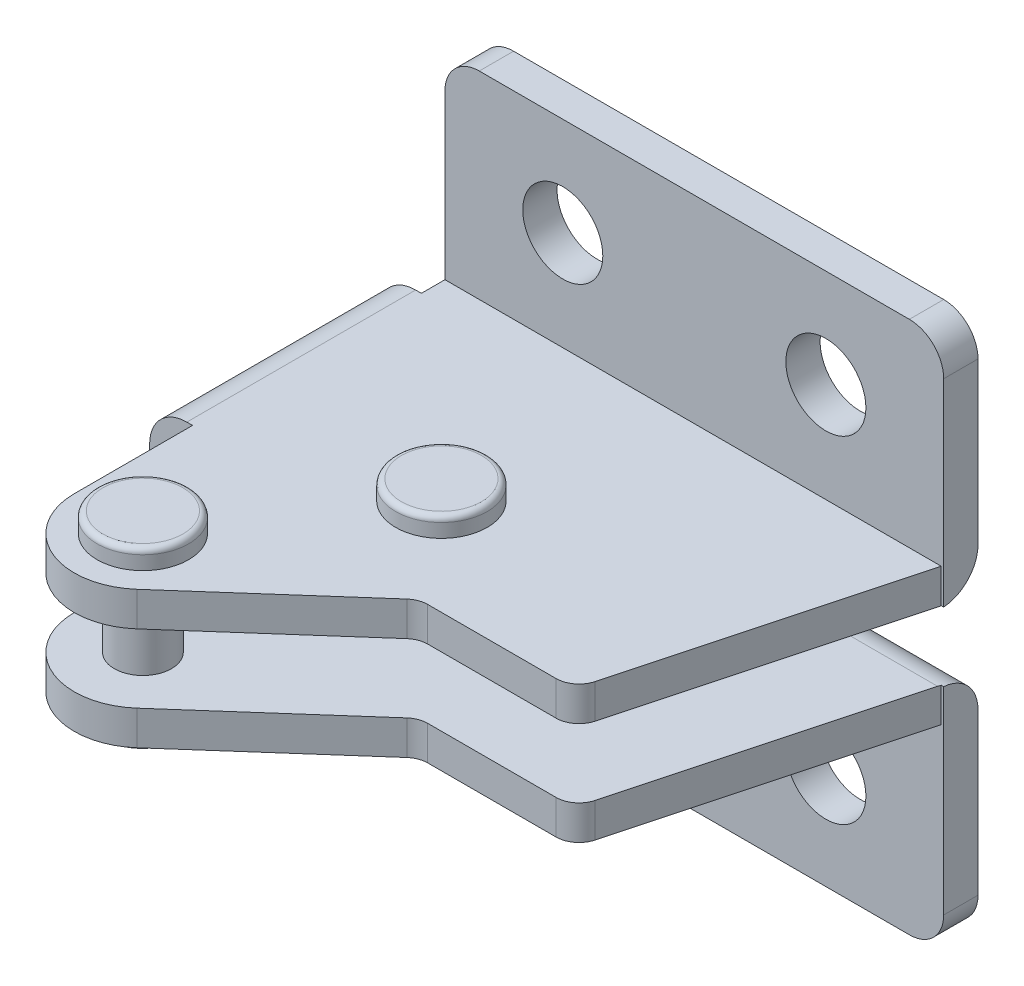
ISO-10303-21;
HEADER;
FILE_DESCRIPTION(('STEP AP214'),'2;1');
FILE_NAME('part.step','',(''),(''),'','','');
FILE_SCHEMA(('AUTOMOTIVE_DESIGN { 1 0 10303 214 1 1 1 1 }'));
ENDSEC;
DATA;
#1=APPLICATION_CONTEXT('core data for automotive mechanical design processes');
#2=APPLICATION_PROTOCOL_DEFINITION('international standard','automotive_design',2000,#1);
#3=PRODUCT_CONTEXT('',#1,'mechanical');
#4=PRODUCT('Part','Part','',(#3));
#5=PRODUCT_RELATED_PRODUCT_CATEGORY('part','',(#4));
#6=PRODUCT_DEFINITION_FORMATION('','',#4);
#7=PRODUCT_DEFINITION_CONTEXT('part definition',#1,'design');
#8=PRODUCT_DEFINITION('design','',#6,#7);
#9=PRODUCT_DEFINITION_SHAPE('','',#8);
#10=(LENGTH_UNIT() NAMED_UNIT(*) SI_UNIT(.MILLI.,.METRE.));
#11=(NAMED_UNIT(*) PLANE_ANGLE_UNIT() SI_UNIT($,.RADIAN.));
#12=(NAMED_UNIT(*) SI_UNIT($,.STERADIAN.) SOLID_ANGLE_UNIT());
#13=UNCERTAINTY_MEASURE_WITH_UNIT(LENGTH_MEASURE(1.E-05),#10,'distance_accuracy_value','');
#14=(GEOMETRIC_REPRESENTATION_CONTEXT(3) GLOBAL_UNCERTAINTY_ASSIGNED_CONTEXT((#13)) GLOBAL_UNIT_ASSIGNED_CONTEXT((#10,
#11,#12)) REPRESENTATION_CONTEXT('',''));
#15=CARTESIAN_POINT('',(0.,0.,0.));
#16=DIRECTION('',(0.,0.,1.));
#17=DIRECTION('',(1.,0.,0.));
#18=AXIS2_PLACEMENT_3D('',#15,#16,#17);
#19=CARTESIAN_POINT('',(6.30566644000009,22.4005532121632,19.9132549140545));
#20=DIRECTION('',(0.,-1.,0.));
#21=DIRECTION('',(0.027277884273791,0.,-0.999627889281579));
#22=AXIS2_PLACEMENT_3D('',#19,#20,#21);
#23=PLANE('',#22);
#24=CARTESIAN_POINT('',(6.30566644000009,22.4005532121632,19.9132549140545));
#25=DIRECTION('',(0.,-1.,0.));
#26=DIRECTION('',(0.0272778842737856,0.,-0.99962788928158));
#27=AXIS2_PLACEMENT_3D('',#24,#25,#26);
#28=CIRCLE('',#27,3.50000000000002);
#29=CARTESIAN_POINT('',(6.40113903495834,22.4005532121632,16.414557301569));
#30=VERTEX_POINT('',#29);
#31=CARTESIAN_POINT('',(6.21019384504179,22.4005532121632,23.4119525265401));
#32=VERTEX_POINT('',#31);
#33=EDGE_CURVE('E373',#30,#32,#28,.T.);
#34=ORIENTED_EDGE('',*,*,#33,.F.);
#35=CARTESIAN_POINT('',(6.30566644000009,22.4005532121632,19.9132549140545));
#36=DIRECTION('',(0.,-1.,0.));
#37=DIRECTION('',(-0.0272778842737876,0.,0.99962788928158));
#38=AXIS2_PLACEMENT_3D('',#35,#36,#37);
#39=CIRCLE('',#38,3.50000000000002);
#40=EDGE_CURVE('E313',#32,#30,#39,.T.);
#41=ORIENTED_EDGE('',*,*,#40,.F.);
#42=EDGE_LOOP('',(#34,#41));
#43=FACE_BOUND('',#42,.T.);
#44=ADVANCED_FACE('F14',(#43),#23,.F.);
#45=CARTESIAN_POINT('',(6.30566644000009,21.9005532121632,19.9132549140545));
#46=DIRECTION('',(0.,-1.,0.));
#47=DIRECTION('',(0.0272778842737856,0.,-0.99962788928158));
#48=AXIS2_PLACEMENT_3D('',#45,#46,#47);
#49=TOROIDAL_SURFACE('',#48,3.50000000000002,0.5);
#50=ORIENTED_EDGE('',*,*,#33,.T.);
#51=ORIENTED_EDGE('',*,*,#40,.T.);
#52=EDGE_LOOP('',(#50,#51));
#53=FACE_BOUND('',#52,.T.);
#54=CARTESIAN_POINT('',(6.30566644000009,21.9005532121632,19.9132549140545));
#55=DIRECTION('',(0.,1.,0.));
#56=DIRECTION('',(-0.027277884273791,0.,0.999627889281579));
#57=AXIS2_PLACEMENT_3D('',#54,#55,#56);
#58=CIRCLE('',#57,4.);
#59=CARTESIAN_POINT('',(6.19655490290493,21.9005532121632,23.9117664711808));
#60=VERTEX_POINT('',#59);
#61=EDGE_CURVE('E318',#60,#60,#58,.F.);
#62=ORIENTED_EDGE('',*,*,#61,.F.);
#63=EDGE_LOOP('',(#62));
#64=FACE_BOUND('',#63,.T.);
#65=ADVANCED_FACE('F336',(#53,#64),#49,.T.);
#66=CARTESIAN_POINT('',(6.30566644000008,20.7005532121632,19.9132549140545));
#67=DIRECTION('',(0.,1.,0.));
#68=DIRECTION('',(-0.027277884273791,0.,0.999627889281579));
#69=AXIS2_PLACEMENT_3D('',#66,#67,#68);
#70=CYLINDRICAL_SURFACE('',#69,4.);
#71=ORIENTED_EDGE('',*,*,#61,.T.);
#72=EDGE_LOOP('',(#71));
#73=FACE_BOUND('',#72,.T.);
#74=CARTESIAN_POINT('',(6.30566644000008,20.7005532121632,19.9132549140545));
#75=DIRECTION('',(0.,-1.,0.));
#76=DIRECTION('',(1.,0.,0.));
#77=AXIS2_PLACEMENT_3D('',#74,#75,#76);
#78=CIRCLE('',#77,4.);
#79=CARTESIAN_POINT('',(10.3056664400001,20.7005532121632,19.9132549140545));
#80=VERTEX_POINT('',#79);
#81=EDGE_CURVE('E773',#80,#80,#78,.T.);
#82=ORIENTED_EDGE('',*,*,#81,.F.);
#83=EDGE_LOOP('',(#82));
#84=FACE_BOUND('',#83,.T.);
#85=ADVANCED_FACE('F16',(#73,#84),#70,.T.);
#86=CARTESIAN_POINT('',(6.30566643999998,7.00055321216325,19.9132549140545));
#87=DIRECTION('',(0.,1.,0.));
#88=DIRECTION('',(-0.027277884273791,0.,0.999627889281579));
#89=AXIS2_PLACEMENT_3D('',#86,#87,#88);
#90=PLANE('',#89);
#91=CARTESIAN_POINT('',(6.30566643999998,7.00055321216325,19.9132549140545));
#92=DIRECTION('',(0.,1.,0.));
#93=DIRECTION('',(-0.0272778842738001,0.,0.999627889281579));
#94=AXIS2_PLACEMENT_3D('',#91,#92,#93);
#95=CIRCLE('',#94,3.49999999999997);
#96=CARTESIAN_POINT('',(6.21019384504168,7.00055321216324,23.41195252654));
#97=VERTEX_POINT('',#96);
#98=CARTESIAN_POINT('',(6.40113903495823,7.00055321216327,16.414557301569));
#99=VERTEX_POINT('',#98);
#100=EDGE_CURVE('E304',#97,#99,#95,.T.);
#101=ORIENTED_EDGE('',*,*,#100,.F.);
#102=CARTESIAN_POINT('',(6.30566643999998,7.00055321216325,19.9132549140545));
#103=DIRECTION('',(0.,1.,0.));
#104=DIRECTION('',(0.0272778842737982,0.,-0.999627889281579));
#105=AXIS2_PLACEMENT_3D('',#102,#103,#104);
#106=CIRCLE('',#105,3.49999999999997);
#107=EDGE_CURVE('E309',#99,#97,#106,.T.);
#108=ORIENTED_EDGE('',*,*,#107,.F.);
#109=EDGE_LOOP('',(#101,#108));
#110=FACE_BOUND('',#109,.T.);
#111=ADVANCED_FACE('F317',(#110),#90,.F.);
#112=CARTESIAN_POINT('',(6.30566643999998,7.50055321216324,19.9132549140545));
#113=DIRECTION('',(0.,1.,0.));
#114=DIRECTION('',(-0.0272778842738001,0.,0.999627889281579));
#115=AXIS2_PLACEMENT_3D('',#112,#113,#114);
#116=TOROIDAL_SURFACE('',#115,3.49999999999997,0.5);
#117=ORIENTED_EDGE('',*,*,#100,.T.);
#118=ORIENTED_EDGE('',*,*,#107,.T.);
#119=EDGE_LOOP('',(#117,#118));
#120=FACE_BOUND('',#119,.T.);
#121=CARTESIAN_POINT('',(6.30566643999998,7.50055321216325,19.9132549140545));
#122=DIRECTION('',(0.,-1.,0.));
#123=DIRECTION('',(0.027277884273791,0.,-0.999627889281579));
#124=AXIS2_PLACEMENT_3D('',#121,#122,#123);
#125=CIRCLE('',#124,4.);
#126=CARTESIAN_POINT('',(6.41477797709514,7.50055321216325,15.9147433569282));
#127=VERTEX_POINT('',#126);
#128=EDGE_CURVE('E1075',#127,#127,#125,.F.);
#129=ORIENTED_EDGE('',*,*,#128,.F.);
#130=EDGE_LOOP('',(#129));
#131=FACE_BOUND('',#130,.T.);
#132=ADVANCED_FACE('F307',(#120,#131),#116,.T.);
#133=CARTESIAN_POINT('',(6.30566643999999,8.70055321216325,19.9132549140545));
#134=DIRECTION('',(0.,-1.,0.));
#135=DIRECTION('',(0.027277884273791,0.,-0.999627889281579));
#136=AXIS2_PLACEMENT_3D('',#133,#134,#135);
#137=CYLINDRICAL_SURFACE('',#136,4.);
#138=ORIENTED_EDGE('',*,*,#128,.T.);
#139=EDGE_LOOP('',(#138));
#140=FACE_BOUND('',#139,.T.);
#141=CARTESIAN_POINT('',(6.30566643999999,8.70055321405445,19.9132549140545));
#142=DIRECTION('',(0.,1.,0.));
#143=DIRECTION('',(0.,0.,1.));
#144=AXIS2_PLACEMENT_3D('',#141,#142,#143);
#145=CIRCLE('',#144,4.);
#146=CARTESIAN_POINT('',(6.30566643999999,8.70055321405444,23.9132549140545));
#147=VERTEX_POINT('',#146);
#148=EDGE_CURVE('E390',#147,#147,#145,.T.);
#149=ORIENTED_EDGE('',*,*,#148,.F.);
#150=EDGE_LOOP('',(#149));
#151=FACE_BOUND('',#150,.T.);
#152=ADVANCED_FACE('F957',(#140,#151),#137,.T.);
#153=CARTESIAN_POINT('',(-62.9,8.70055321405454,-13.4994467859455));
#154=DIRECTION('',(0.,1.,0.));
#155=DIRECTION('',(-1.,0.,0.));
#156=AXIS2_PLACEMENT_3D('',#153,#154,#155);
#157=PLANE('',#156);
#158=ORIENTED_EDGE('',*,*,#148,.T.);
#159=EDGE_LOOP('',(#158));
#160=FACE_BOUND('',#159,.T.);
#161=DIRECTION('',(0.,0.,1.));
#162=VECTOR('',#161,1.);
#163=CARTESIAN_POINT('',(-10.3,8.7005532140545,5.06305321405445));
#164=LINE('',#163,#162);
#165=CARTESIAN_POINT('',(-10.3,8.7005532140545,5.06305321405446));
#166=VERTEX_POINT('',#165);
#167=CARTESIAN_POINT('',(-10.3,8.7005532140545,3.));
#168=VERTEX_POINT('',#167);
#169=EDGE_CURVE('E480',#166,#168,#164,.F.);
#170=ORIENTED_EDGE('',*,*,#169,.T.);
#171=DIRECTION('',(1.,0.,0.));
#172=VECTOR('',#171,1.);
#173=CARTESIAN_POINT('',(-62.9,8.70055321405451,3.));
#174=LINE('',#173,#172);
#175=CARTESIAN_POINT('',(33.0846735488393,8.70055321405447,3.));
#176=VERTEX_POINT('',#175);
#177=EDGE_CURVE('E757',#168,#176,#174,.T.);
#178=ORIENTED_EDGE('',*,*,#177,.T.);
#179=DIRECTION('',(0.258819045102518,0.,-0.965925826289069));
#180=VECTOR('',#179,1.);
#181=CARTESIAN_POINT('',(26.6919677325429,8.70055321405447,26.8579029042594));
#182=LINE('',#181,#180);
#183=CARTESIAN_POINT('',(26.6919677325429,8.70055321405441,26.8579029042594));
#184=VERTEX_POINT('',#183);
#185=EDGE_CURVE('E426',#176,#184,#182,.F.);
#186=ORIENTED_EDGE('',*,*,#185,.T.);
#187=CARTESIAN_POINT('',(24.7601160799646,8.70055321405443,26.3402648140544));
#188=DIRECTION('',(0.,1.,0.));
#189=DIRECTION('',(-1.,0.,0.));
#190=AXIS2_PLACEMENT_3D('',#187,#188,#189);
#191=CIRCLE('',#190,2.00000000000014);
#192=CARTESIAN_POINT('',(24.7601160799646,8.70055321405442,28.3402648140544));
#193=VERTEX_POINT('',#192);
#194=EDGE_CURVE('E427',#193,#184,#191,.T.);
#195=ORIENTED_EDGE('',*,*,#194,.F.);
#196=DIRECTION('',(1.,0.,0.));
#197=VECTOR('',#196,1.);
#198=CARTESIAN_POINT('',(13.536,8.70055321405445,28.3402648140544));
#199=LINE('',#198,#197);
#200=CARTESIAN_POINT('',(13.536,8.70055321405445,28.3402648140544));
#201=VERTEX_POINT('',#200);
#202=EDGE_CURVE('E438',#193,#201,#199,.F.);
#203=ORIENTED_EDGE('',*,*,#202,.T.);
#204=CARTESIAN_POINT('',(13.536,8.70055321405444,30.3402648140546));
#205=DIRECTION('',(0.,1.,0.));
#206=DIRECTION('',(-1.,0.,0.));
#207=AXIS2_PLACEMENT_3D('',#204,#205,#206);
#208=CIRCLE('',#207,2.00000000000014);
#209=CARTESIAN_POINT('',(12.2128699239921,8.70055321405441,28.8404892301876));
#210=VERTEX_POINT('',#209);
#211=EDGE_CURVE('E476',#210,#201,#208,.F.);
#212=ORIENTED_EDGE('',*,*,#211,.F.);
#213=DIRECTION('',(0.749887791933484,0.,-0.661565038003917));
#214=VECTOR('',#213,1.);
#215=CARTESIAN_POINT('',(-0.330609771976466,8.70055321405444,39.9065816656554));
#216=LINE('',#215,#214);
#217=CARTESIAN_POINT('',(-0.330609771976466,8.70055321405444,39.9065816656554));
#218=VERTEX_POINT('',#217);
#219=EDGE_CURVE('E441',#210,#218,#216,.F.);
#220=ORIENTED_EDGE('',*,*,#219,.T.);
#221=CARTESIAN_POINT('',(-4.3,8.7005532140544,35.4072549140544));
#222=DIRECTION('',(0.,1.,0.));
#223=DIRECTION('',(-1.,0.,0.));
#224=AXIS2_PLACEMENT_3D('',#221,#222,#223);
#225=CIRCLE('',#224,6.);
#226=CARTESIAN_POINT('',(-10.3,8.70055321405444,35.4072549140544));
#227=VERTEX_POINT('',#226);
#228=EDGE_CURVE('E444',#227,#218,#225,.T.);
#229=ORIENTED_EDGE('',*,*,#228,.F.);
#230=DIRECTION('',(0.,0.,1.));
#231=VECTOR('',#230,1.);
#232=CARTESIAN_POINT('',(-10.3,8.70055321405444,25.0630532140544));
#233=LINE('',#232,#231);
#234=CARTESIAN_POINT('',(-10.3,8.70055321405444,25.0630532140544));
#235=VERTEX_POINT('',#234);
#236=EDGE_CURVE('E451',#227,#235,#233,.F.);
#237=ORIENTED_EDGE('',*,*,#236,.T.);
#238=DIRECTION('',(-1.,0.,0.));
#239=VECTOR('',#238,1.);
#240=CARTESIAN_POINT('',(-62.9,8.70055321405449,25.0630532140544));
#241=LINE('',#240,#239);
#242=CARTESIAN_POINT('',(-10.8011064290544,8.70055321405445,25.0630532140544));
#243=VERTEX_POINT('',#242);
#244=EDGE_CURVE('E474',#243,#235,#241,.F.);
#245=ORIENTED_EDGE('',*,*,#244,.F.);
#246=DIRECTION('',(0.,0.,1.));
#247=VECTOR('',#246,1.);
#248=CARTESIAN_POINT('',(-10.8011064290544,8.70055321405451,-13.4994467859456));
#249=LINE('',#248,#247);
#250=CARTESIAN_POINT('',(-10.8011064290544,8.70055321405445,5.06305321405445));
#251=VERTEX_POINT('',#250);
#252=EDGE_CURVE('E477',#251,#243,#249,.T.);
#253=ORIENTED_EDGE('',*,*,#252,.F.);
#254=DIRECTION('',(-1.,0.,0.));
#255=VECTOR('',#254,1.);
#256=CARTESIAN_POINT('',(-62.9,8.70055321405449,5.06305321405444));
#257=LINE('',#256,#255);
#258=EDGE_CURVE('E485',#166,#251,#257,.T.);
#259=ORIENTED_EDGE('',*,*,#258,.F.);
#260=EDGE_LOOP('',(#170,#178,#186,#195,#203,#212,#220,#229,#237,#245,#253,#259));
#261=FACE_BOUND('',#260,.T.);
#262=CARTESIAN_POINT('',(-4.3,8.70055321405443,35.4072549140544));
#263=DIRECTION('',(0.,1.,0.));
#264=DIRECTION('',(0.,0.,1.));
#265=AXIS2_PLACEMENT_3D('',#262,#263,#264);
#266=CIRCLE('',#265,4.);
#267=CARTESIAN_POINT('',(-4.3,8.70055321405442,39.4072549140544));
#268=VERTEX_POINT('',#267);
#269=EDGE_CURVE('E778',#268,#268,#266,.T.);
#270=ORIENTED_EDGE('',*,*,#269,.T.);
#271=EDGE_LOOP('',(#270));
#272=FACE_BOUND('',#271,.T.);
#273=ADVANCED_FACE('F873',(#160,#261,#272),#157,.F.);
#274=CARTESIAN_POINT('',(30.3,20.7005532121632,-13.4994467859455));
#275=DIRECTION('',(0.,-1.,0.));
#276=DIRECTION('',(1.,0.,0.));
#277=AXIS2_PLACEMENT_3D('',#274,#275,#276);
#278=PLANE('',#277);
#279=ORIENTED_EDGE('',*,*,#81,.T.);
#280=EDGE_LOOP('',(#279));
#281=FACE_BOUND('',#280,.T.);
#282=DIRECTION('',(0.258819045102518,0.,-0.965925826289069));
#283=VECTOR('',#282,1.);
#284=CARTESIAN_POINT('',(26.6919677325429,20.7005532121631,26.8579029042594));
#285=LINE('',#284,#283);
#286=CARTESIAN_POINT('',(26.6919677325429,20.7005532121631,26.8579029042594));
#287=VERTEX_POINT('',#286);
#288=CARTESIAN_POINT('',(33.0846735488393,20.7005532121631,3.));
#289=VERTEX_POINT('',#288);
#290=EDGE_CURVE('E591',#287,#289,#285,.T.);
#291=ORIENTED_EDGE('',*,*,#290,.T.);
#292=DIRECTION('',(1.,0.,0.));
#293=VECTOR('',#292,1.);
#294=CARTESIAN_POINT('',(30.3,20.7005532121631,3.));
#295=LINE('',#294,#293);
#296=CARTESIAN_POINT('',(-10.3,20.7005532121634,3.));
#297=VERTEX_POINT('',#296);
#298=EDGE_CURVE('E781',#297,#289,#295,.T.);
#299=ORIENTED_EDGE('',*,*,#298,.F.);
#300=DIRECTION('',(0.,0.,1.));
#301=VECTOR('',#300,1.);
#302=CARTESIAN_POINT('',(-10.3,20.7005532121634,5.06305321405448));
#303=LINE('',#302,#301);
#304=CARTESIAN_POINT('',(-10.3,20.7005532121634,5.06305321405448));
#305=VERTEX_POINT('',#304);
#306=EDGE_CURVE('E603',#297,#305,#303,.T.);
#307=ORIENTED_EDGE('',*,*,#306,.T.);
#308=DIRECTION('',(-1.,0.,0.));
#309=VECTOR('',#308,1.);
#310=CARTESIAN_POINT('',(-10.3,20.7005532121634,5.06305321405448));
#311=LINE('',#310,#309);
#312=CARTESIAN_POINT('',(-10.8011064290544,20.7005532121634,5.06305321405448));
#313=VERTEX_POINT('',#312);
#314=EDGE_CURVE('E607',#305,#313,#311,.T.);
#315=ORIENTED_EDGE('',*,*,#314,.T.);
#316=DIRECTION('',(0.,0.,-1.));
#317=VECTOR('',#316,1.);
#318=CARTESIAN_POINT('',(-10.8011064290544,20.7005532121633,35.4727669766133));
#319=LINE('',#318,#317);
#320=CARTESIAN_POINT('',(-10.8011064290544,20.7005532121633,25.0630532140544));
#321=VERTEX_POINT('',#320);
#322=EDGE_CURVE('E599',#321,#313,#319,.T.);
#323=ORIENTED_EDGE('',*,*,#322,.F.);
#324=DIRECTION('',(1.,0.,0.));
#325=VECTOR('',#324,1.);
#326=CARTESIAN_POINT('',(-10.3,20.7005532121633,25.0630532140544));
#327=LINE('',#326,#325);
#328=CARTESIAN_POINT('',(-10.3,20.7005532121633,25.0630532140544));
#329=VERTEX_POINT('',#328);
#330=EDGE_CURVE('E618',#321,#329,#327,.T.);
#331=ORIENTED_EDGE('',*,*,#330,.T.);
#332=DIRECTION('',(0.,0.,1.));
#333=VECTOR('',#332,1.);
#334=CARTESIAN_POINT('',(-10.3,20.7005532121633,25.0630532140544));
#335=LINE('',#334,#333);
#336=CARTESIAN_POINT('',(-10.3,20.7005532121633,35.4072549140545));
#337=VERTEX_POINT('',#336);
#338=EDGE_CURVE('E568',#329,#337,#335,.T.);
#339=ORIENTED_EDGE('',*,*,#338,.T.);
#340=CARTESIAN_POINT('',(-4.29999999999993,20.7005532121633,35.4072549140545));
#341=DIRECTION('',(0.,-1.,0.));
#342=DIRECTION('',(1.,0.,0.));
#343=AXIS2_PLACEMENT_3D('',#340,#341,#342);
#344=CIRCLE('',#343,6.);
#345=CARTESIAN_POINT('',(-0.330609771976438,20.7005532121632,39.9065816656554));
#346=VERTEX_POINT('',#345);
#347=EDGE_CURVE('E572',#346,#337,#344,.T.);
#348=ORIENTED_EDGE('',*,*,#347,.F.);
#349=DIRECTION('',(0.749887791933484,0.,-0.661565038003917));
#350=VECTOR('',#349,1.);
#351=CARTESIAN_POINT('',(-0.330609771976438,20.7005532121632,39.9065816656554));
#352=LINE('',#351,#350);
#353=CARTESIAN_POINT('',(12.2128699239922,20.7005532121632,28.8404892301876));
#354=VERTEX_POINT('',#353);
#355=EDGE_CURVE('E581',#346,#354,#352,.T.);
#356=ORIENTED_EDGE('',*,*,#355,.T.);
#357=CARTESIAN_POINT('',(13.536,20.7005532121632,30.3402648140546));
#358=DIRECTION('',(0.,-1.,0.));
#359=DIRECTION('',(1.,0.,0.));
#360=AXIS2_PLACEMENT_3D('',#357,#358,#359);
#361=CIRCLE('',#360,2.00000000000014);
#362=CARTESIAN_POINT('',(13.536,20.7005532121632,28.3402648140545));
#363=VERTEX_POINT('',#362);
#364=EDGE_CURVE('E622',#363,#354,#361,.F.);
#365=ORIENTED_EDGE('',*,*,#364,.F.);
#366=DIRECTION('',(1.,0.,0.));
#367=VECTOR('',#366,1.);
#368=CARTESIAN_POINT('',(13.536,20.7005532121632,28.3402648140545));
#369=LINE('',#368,#367);
#370=CARTESIAN_POINT('',(24.7601160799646,20.7005532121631,28.3402648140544));
#371=VERTEX_POINT('',#370);
#372=EDGE_CURVE('E584',#363,#371,#369,.T.);
#373=ORIENTED_EDGE('',*,*,#372,.T.);
#374=CARTESIAN_POINT('',(24.7601160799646,20.7005532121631,26.3402648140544));
#375=DIRECTION('',(0.,-1.,0.));
#376=DIRECTION('',(1.,0.,0.));
#377=AXIS2_PLACEMENT_3D('',#374,#375,#376);
#378=CIRCLE('',#377,2.00000000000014);
#379=EDGE_CURVE('E587',#287,#371,#378,.T.);
#380=ORIENTED_EDGE('',*,*,#379,.F.);
#381=EDGE_LOOP('',(#291,#299,#307,#315,#323,#331,#339,#348,#356,#365,#373,#380));
#382=FACE_BOUND('',#381,.T.);
#383=CARTESIAN_POINT('',(-4.29999999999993,20.7005532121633,35.4072549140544));
#384=DIRECTION('',(0.,-1.,0.));
#385=DIRECTION('',(1.,0.,0.));
#386=AXIS2_PLACEMENT_3D('',#383,#384,#385);
#387=CIRCLE('',#386,4.);
#388=CARTESIAN_POINT('',(-0.299999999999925,20.7005532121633,35.4072549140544));
#389=VERTEX_POINT('',#388);
#390=EDGE_CURVE('E770',#389,#389,#387,.T.);
#391=ORIENTED_EDGE('',*,*,#390,.T.);
#392=EDGE_LOOP('',(#391));
#393=FACE_BOUND('',#392,.T.);
#394=ADVANCED_FACE('F816',(#281,#382,#393),#278,.F.);
#395=CARTESIAN_POINT('',(6.30566644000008,20.7005532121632,19.9132549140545));
#396=DIRECTION('',(0.,-1.,0.));
#397=DIRECTION('',(0.027277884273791,0.,-0.999627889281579));
#398=AXIS2_PLACEMENT_3D('',#395,#396,#397);
#399=CYLINDRICAL_SURFACE('',#398,2.5);
#400=CARTESIAN_POINT('',(6.30566644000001,11.7005532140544,19.9132549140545));
#401=DIRECTION('',(0.,1.,0.));
#402=DIRECTION('',(-1.,0.,0.));
#403=AXIS2_PLACEMENT_3D('',#400,#401,#402);
#404=CIRCLE('',#403,2.5);
#405=CARTESIAN_POINT('',(3.80566644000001,11.7005532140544,19.9132549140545));
#406=VERTEX_POINT('',#405);
#407=EDGE_CURVE('E761',#406,#406,#404,.F.);
#408=ORIENTED_EDGE('',*,*,#407,.F.);
#409=EDGE_LOOP('',(#408));
#410=FACE_BOUND('',#409,.T.);
#411=CARTESIAN_POINT('',(6.30566644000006,17.7005532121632,19.9132549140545));
#412=DIRECTION('',(0.,-1.,0.));
#413=DIRECTION('',(0.,0.,1.));
#414=AXIS2_PLACEMENT_3D('',#411,#412,#413);
#415=CIRCLE('',#414,2.5);
#416=CARTESIAN_POINT('',(6.30566644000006,17.7005532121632,22.4132549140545));
#417=VERTEX_POINT('',#416);
#418=EDGE_CURVE('E1077',#417,#417,#415,.F.);
#419=ORIENTED_EDGE('',*,*,#418,.F.);
#420=EDGE_LOOP('',(#419));
#421=FACE_BOUND('',#420,.T.);
#422=ADVANCED_FACE('F989',(#410,#421),#399,.T.);
#423=CARTESIAN_POINT('',(23.,0.,0.));
#424=DIRECTION('',(0.,0.,-1.));
#425=DIRECTION('',(1.,0.,0.));
#426=AXIS2_PLACEMENT_3D('',#423,#424,#425);
#427=CYLINDRICAL_SURFACE('',#426,3.5);
#428=CARTESIAN_POINT('',(23.,0.,0.));
#429=DIRECTION('',(0.,0.,-1.));
#430=DIRECTION('',(1.,0.,0.));
#431=AXIS2_PLACEMENT_3D('',#428,#429,#430);
#432=CIRCLE('',#431,3.5);
#433=CARTESIAN_POINT('',(26.5,0.,0.));
#434=VERTEX_POINT('',#433);
#435=EDGE_CURVE('E528',#434,#434,#432,.F.);
#436=ORIENTED_EDGE('',*,*,#435,.F.);
#437=EDGE_LOOP('',(#436));
#438=FACE_BOUND('',#437,.T.);
#439=CARTESIAN_POINT('',(23.,0.,3.));
#440=DIRECTION('',(0.,0.,-1.));
#441=DIRECTION('',(1.,0.,0.));
#442=AXIS2_PLACEMENT_3D('',#439,#440,#441);
#443=CIRCLE('',#442,3.5);
#444=CARTESIAN_POINT('',(26.5,0.,3.));
#445=VERTEX_POINT('',#444);
#446=EDGE_CURVE('E562',#445,#445,#443,.T.);
#447=ORIENTED_EDGE('',*,*,#446,.F.);
#448=EDGE_LOOP('',(#447));
#449=FACE_BOUND('',#448,.T.);
#450=ADVANCED_FACE('F985',(#438,#449),#427,.F.);
#451=CARTESIAN_POINT('',(0.,0.,0.));
#452=DIRECTION('',(0.,0.,-1.));
#453=DIRECTION('',(1.,0.,0.));
#454=AXIS2_PLACEMENT_3D('',#451,#452,#453);
#455=CYLINDRICAL_SURFACE('',#454,3.5);
#456=CARTESIAN_POINT('',(0.,0.,0.));
#457=DIRECTION('',(0.,0.,-1.));
#458=DIRECTION('',(1.,0.,0.));
#459=AXIS2_PLACEMENT_3D('',#456,#457,#458);
#460=CIRCLE('',#459,3.5);
#461=CARTESIAN_POINT('',(3.5,0.,0.));
#462=VERTEX_POINT('',#461);
#463=EDGE_CURVE('E508',#462,#462,#460,.F.);
#464=ORIENTED_EDGE('',*,*,#463,.F.);
#465=EDGE_LOOP('',(#464));
#466=FACE_BOUND('',#465,.T.);
#467=CARTESIAN_POINT('',(0.,0.,3.));
#468=DIRECTION('',(0.,0.,-1.));
#469=DIRECTION('',(1.,0.,0.));
#470=AXIS2_PLACEMENT_3D('',#467,#468,#469);
#471=CIRCLE('',#470,3.5);
#472=CARTESIAN_POINT('',(3.5,0.,3.));
#473=VERTEX_POINT('',#472);
#474=EDGE_CURVE('E524',#473,#473,#471,.T.);
#475=ORIENTED_EDGE('',*,*,#474,.F.);
#476=EDGE_LOOP('',(#475));
#477=FACE_BOUND('',#476,.T.);
#478=ADVANCED_FACE('F981',(#466,#477),#455,.F.);
#479=CARTESIAN_POINT('',(-7.29884050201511,-5.59944678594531,3.));
#480=DIRECTION('',(0.,0.,-1.));
#481=DIRECTION('',(0.,-1.,0.));
#482=AXIS2_PLACEMENT_3D('',#479,#480,#481);
#483=CYLINDRICAL_SURFACE('',#482,3.);
#484=CARTESIAN_POINT('',(-7.29884050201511,-5.59944678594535,0.));
#485=DIRECTION('',(0.,0.,-1.));
#486=DIRECTION('',(0.,-1.,0.));
#487=AXIS2_PLACEMENT_3D('',#484,#485,#486);
#488=CIRCLE('',#487,3.);
#489=CARTESIAN_POINT('',(-7.29884050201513,-8.59944678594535,0.));
#490=VERTEX_POINT('',#489);
#491=CARTESIAN_POINT('',(-10.298493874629,-5.64504990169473,0.));
#492=VERTEX_POINT('',#491);
#493=EDGE_CURVE('E736',#490,#492,#488,.T.);
#494=ORIENTED_EDGE('',*,*,#493,.F.);
#495=DIRECTION('',(0.,0.,1.));
#496=VECTOR('',#495,1.);
#497=CARTESIAN_POINT('',(-7.29884050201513,-8.59944678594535,0.));
#498=LINE('',#497,#496);
#499=CARTESIAN_POINT('',(-7.29884050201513,-8.59944678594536,2.99999999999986));
#500=VERTEX_POINT('',#499);
#501=EDGE_CURVE('E409',#500,#490,#498,.F.);
#502=ORIENTED_EDGE('',*,*,#501,.F.);
#503=CARTESIAN_POINT('',(-7.29884050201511,-5.59944678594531,3.));
#504=DIRECTION('',(0.,0.,-1.));
#505=DIRECTION('',(0.,-1.,0.));
#506=AXIS2_PLACEMENT_3D('',#503,#504,#505);
#507=CIRCLE('',#506,3.);
#508=CARTESIAN_POINT('',(-10.298493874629,-5.64504990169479,3.));
#509=VERTEX_POINT('',#508);
#510=EDGE_CURVE('E730',#509,#500,#507,.F.);
#511=ORIENTED_EDGE('',*,*,#510,.F.);
#512=DIRECTION('',(0.,0.,-1.));
#513=VECTOR('',#512,1.);
#514=CARTESIAN_POINT('',(-10.298493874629,-5.64504990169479,3.));
#515=LINE('',#514,#513);
#516=EDGE_CURVE('E393',#509,#492,#515,.T.);
#517=ORIENTED_EDGE('',*,*,#516,.T.);
#518=EDGE_LOOP('',(#494,#502,#511,#517));
#519=FACE_BOUND('',#518,.T.);
#520=ADVANCED_FACE('F984',(#519),#483,.T.);
#521=CARTESIAN_POINT('',(33.3,-8.59944678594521,-43.705008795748));
#522=DIRECTION('',(0.,-1.,0.));
#523=DIRECTION('',(0.,0.,1.));
#524=AXIS2_PLACEMENT_3D('',#521,#522,#523);
#525=PLANE('',#524);
#526=DIRECTION('',(1.,0.,0.));
#527=VECTOR('',#526,1.);
#528=CARTESIAN_POINT('',(33.3,-8.59944678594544,0.));
#529=LINE('',#528,#527);
#530=CARTESIAN_POINT('',(30.3,-8.59944678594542,0.));
#531=VERTEX_POINT('',#530);
#532=EDGE_CURVE('E389',#490,#531,#529,.T.);
#533=ORIENTED_EDGE('',*,*,#532,.T.);
#534=DIRECTION('',(0.,0.,1.));
#535=VECTOR('',#534,1.);
#536=CARTESIAN_POINT('',(30.3,-8.59944678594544,2.99999999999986));
#537=LINE('',#536,#535);
#538=CARTESIAN_POINT('',(30.3,-8.59944678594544,2.99999999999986));
#539=VERTEX_POINT('',#538);
#540=EDGE_CURVE('E727',#531,#539,#537,.T.);
#541=ORIENTED_EDGE('',*,*,#540,.T.);
#542=DIRECTION('',(1.,0.,0.));
#543=VECTOR('',#542,1.);
#544=CARTESIAN_POINT('',(33.3,-8.59944678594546,2.99999999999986));
#545=LINE('',#544,#543);
#546=EDGE_CURVE('E386',#500,#539,#545,.T.);
#547=ORIENTED_EDGE('',*,*,#546,.F.);
#548=ORIENTED_EDGE('',*,*,#501,.T.);
#549=EDGE_LOOP('',(#533,#541,#547,#548));
#550=FACE_BOUND('',#549,.T.);
#551=ADVANCED_FACE('F1044',(#550),#525,.T.);
#552=CARTESIAN_POINT('',(30.3,-5.59944678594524,-43.7050087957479));
#553=DIRECTION('',(0.,0.,-1.));
#554=DIRECTION('',(0.,-1.,0.));
#555=AXIS2_PLACEMENT_3D('',#552,#553,#554);
#556=CYLINDRICAL_SURFACE('',#555,3.);
#557=CARTESIAN_POINT('',(30.3,-5.59944678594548,0.));
#558=DIRECTION('',(0.,0.,-1.));
#559=DIRECTION('',(0.,-1.,0.));
#560=AXIS2_PLACEMENT_3D('',#557,#558,#559);
#561=CIRCLE('',#560,3.);
#562=CARTESIAN_POINT('',(33.3,-5.59944678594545,0.));
#563=VERTEX_POINT('',#562);
#564=EDGE_CURVE('E738',#563,#531,#561,.T.);
#565=ORIENTED_EDGE('',*,*,#564,.F.);
#566=DIRECTION('',(0.,0.,1.));
#567=VECTOR('',#566,1.);
#568=CARTESIAN_POINT('',(33.3,-5.59944678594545,0.));
#569=LINE('',#568,#567);
#570=CARTESIAN_POINT('',(33.3,-5.59944678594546,3.));
#571=VERTEX_POINT('',#570);
#572=EDGE_CURVE('E734',#571,#563,#569,.F.);
#573=ORIENTED_EDGE('',*,*,#572,.F.);
#574=CARTESIAN_POINT('',(30.3,-5.59944678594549,3.));
#575=DIRECTION('',(0.,0.,-1.));
#576=DIRECTION('',(0.,-1.,0.));
#577=AXIS2_PLACEMENT_3D('',#574,#575,#576);
#578=CIRCLE('',#577,3.);
#579=EDGE_CURVE('E732',#539,#571,#578,.F.);
#580=ORIENTED_EDGE('',*,*,#579,.F.);
#581=ORIENTED_EDGE('',*,*,#540,.F.);
#582=EDGE_LOOP('',(#565,#573,#580,#581));
#583=FACE_BOUND('',#582,.T.);
#584=ADVANCED_FACE('F1038',(#583),#556,.T.);
#585=CARTESIAN_POINT('',(23.,29.4,0.));
#586=DIRECTION('',(0.,0.,-1.));
#587=DIRECTION('',(1.,0.,0.));
#588=AXIS2_PLACEMENT_3D('',#585,#586,#587);
#589=CYLINDRICAL_SURFACE('',#588,3.5);
#590=CARTESIAN_POINT('',(23.,29.4,0.));
#591=DIRECTION('',(0.,0.,-1.));
#592=DIRECTION('',(1.,0.,0.));
#593=AXIS2_PLACEMENT_3D('',#590,#591,#592);
#594=CIRCLE('',#593,3.5);
#595=CARTESIAN_POINT('',(26.5,29.4,0.));
#596=VERTEX_POINT('',#595);
#597=EDGE_CURVE('E651',#596,#596,#594,.F.);
#598=ORIENTED_EDGE('',*,*,#597,.F.);
#599=EDGE_LOOP('',(#598));
#600=FACE_BOUND('',#599,.T.);
#601=CARTESIAN_POINT('',(23.,29.4,3.00000000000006));
#602=DIRECTION('',(0.,0.,-1.));
#603=DIRECTION('',(1.,0.,0.));
#604=AXIS2_PLACEMENT_3D('',#601,#602,#603);
#605=CIRCLE('',#604,3.5);
#606=CARTESIAN_POINT('',(26.5,29.4,3.00000000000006));
#607=VERTEX_POINT('',#606);
#608=EDGE_CURVE('E405',#607,#607,#605,.T.);
#609=ORIENTED_EDGE('',*,*,#608,.F.);
#610=EDGE_LOOP('',(#609));
#611=FACE_BOUND('',#610,.T.);
#612=ADVANCED_FACE('F1034',(#600,#611),#589,.F.);
#613=CARTESIAN_POINT('',(1.16226472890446E-13,29.4,0.));
#614=DIRECTION('',(0.,0.,-1.));
#615=DIRECTION('',(1.,0.,0.));
#616=AXIS2_PLACEMENT_3D('',#613,#614,#615);
#617=CYLINDRICAL_SURFACE('',#616,3.5);
#618=CARTESIAN_POINT('',(1.16226472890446E-13,29.4,0.));
#619=DIRECTION('',(0.,0.,-1.));
#620=DIRECTION('',(1.,0.,0.));
#621=AXIS2_PLACEMENT_3D('',#618,#619,#620);
#622=CIRCLE('',#621,3.5);
#623=CARTESIAN_POINT('',(3.50000000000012,29.4,0.));
#624=VERTEX_POINT('',#623);
#625=EDGE_CURVE('E644',#624,#624,#622,.F.);
#626=ORIENTED_EDGE('',*,*,#625,.F.);
#627=EDGE_LOOP('',(#626));
#628=FACE_BOUND('',#627,.T.);
#629=CARTESIAN_POINT('',(1.16226472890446E-13,29.4,3.00000000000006));
#630=DIRECTION('',(0.,0.,-1.));
#631=DIRECTION('',(1.,0.,0.));
#632=AXIS2_PLACEMENT_3D('',#629,#630,#631);
#633=CIRCLE('',#632,3.5);
#634=CARTESIAN_POINT('',(3.50000000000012,29.4,3.00000000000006));
#635=VERTEX_POINT('',#634);
#636=EDGE_CURVE('E721',#635,#635,#633,.T.);
#637=ORIENTED_EDGE('',*,*,#636,.F.);
#638=EDGE_LOOP('',(#637));
#639=FACE_BOUND('',#638,.T.);
#640=ADVANCED_FACE('F1030',(#628,#639),#617,.F.);
#641=CARTESIAN_POINT('',(30.3,35.0005532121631,3.2500000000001));
#642=DIRECTION('',(0.,0.,-1.));
#643=DIRECTION('',(0.,-1.,0.));
#644=AXIS2_PLACEMENT_3D('',#641,#642,#643);
#645=CYLINDRICAL_SURFACE('',#644,3.);
#646=CARTESIAN_POINT('',(30.3,35.0005532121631,0.));
#647=DIRECTION('',(0.,0.,-1.));
#648=DIRECTION('',(0.,-1.,0.));
#649=AXIS2_PLACEMENT_3D('',#646,#647,#648);
#650=CIRCLE('',#649,3.);
#651=CARTESIAN_POINT('',(30.3,38.0005532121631,0.));
#652=VERTEX_POINT('',#651);
#653=CARTESIAN_POINT('',(33.3,35.0005532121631,0.));
#654=VERTEX_POINT('',#653);
#655=EDGE_CURVE('E749',#652,#654,#650,.T.);
#656=ORIENTED_EDGE('',*,*,#655,.F.);
#657=DIRECTION('',(0.,0.,1.));
#658=VECTOR('',#657,1.);
#659=CARTESIAN_POINT('',(30.3,38.0005532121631,0.));
#660=LINE('',#659,#658);
#661=CARTESIAN_POINT('',(30.3,38.0005532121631,3.0000000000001));
#662=VERTEX_POINT('',#661);
#663=EDGE_CURVE('E740',#662,#652,#660,.F.);
#664=ORIENTED_EDGE('',*,*,#663,.F.);
#665=CARTESIAN_POINT('',(30.3,35.0005532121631,3.00000000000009));
#666=DIRECTION('',(0.,0.,-1.));
#667=DIRECTION('',(0.,-1.,0.));
#668=AXIS2_PLACEMENT_3D('',#665,#666,#667);
#669=CIRCLE('',#668,3.);
#670=CARTESIAN_POINT('',(33.3,35.0005532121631,3.00000000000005));
#671=VERTEX_POINT('',#670);
#672=EDGE_CURVE('E745',#671,#662,#669,.F.);
#673=ORIENTED_EDGE('',*,*,#672,.F.);
#674=DIRECTION('',(0.,0.,1.));
#675=VECTOR('',#674,1.);
#676=CARTESIAN_POINT('',(33.3,35.0005532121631,3.00000000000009));
#677=LINE('',#676,#675);
#678=EDGE_CURVE('E753',#654,#671,#677,.T.);
#679=ORIENTED_EDGE('',*,*,#678,.F.);
#680=EDGE_LOOP('',(#656,#664,#673,#679));
#681=FACE_BOUND('',#680,.T.);
#682=ADVANCED_FACE('F1033',(#681),#645,.T.);
#683=CARTESIAN_POINT('',(-7.29884050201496,35.0005532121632,3.00000000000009));
#684=DIRECTION('',(0.,0.,-1.));
#685=DIRECTION('',(0.,-1.,0.));
#686=AXIS2_PLACEMENT_3D('',#683,#684,#685);
#687=CYLINDRICAL_SURFACE('',#686,3.);
#688=CARTESIAN_POINT('',(-7.29884050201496,35.0005532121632,0.));
#689=DIRECTION('',(0.,0.,-1.));
#690=DIRECTION('',(0.,-1.,0.));
#691=AXIS2_PLACEMENT_3D('',#688,#689,#690);
#692=CIRCLE('',#691,3.);
#693=CARTESIAN_POINT('',(-10.2984938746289,35.0461563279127,0.));
#694=VERTEX_POINT('',#693);
#695=CARTESIAN_POINT('',(-7.29884050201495,38.0005532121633,1.00722381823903E-13));
#696=VERTEX_POINT('',#695);
#697=EDGE_CURVE('E751',#694,#696,#692,.T.);
#698=ORIENTED_EDGE('',*,*,#697,.F.);
#699=DIRECTION('',(0.,0.,-1.));
#700=VECTOR('',#699,1.);
#701=CARTESIAN_POINT('',(-10.2984938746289,35.0461563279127,3.00000000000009));
#702=LINE('',#701,#700);
#703=CARTESIAN_POINT('',(-10.2984938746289,35.0461563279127,3.00000000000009));
#704=VERTEX_POINT('',#703);
#705=EDGE_CURVE('E402',#694,#704,#702,.F.);
#706=ORIENTED_EDGE('',*,*,#705,.T.);
#707=CARTESIAN_POINT('',(-7.29884050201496,35.0005532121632,3.00000000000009));
#708=DIRECTION('',(0.,0.,-1.));
#709=DIRECTION('',(0.,-1.,0.));
#710=AXIS2_PLACEMENT_3D('',#707,#708,#709);
#711=CIRCLE('',#710,3.);
#712=CARTESIAN_POINT('',(-7.29884050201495,38.0005532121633,3.0000000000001));
#713=VERTEX_POINT('',#712);
#714=EDGE_CURVE('E747',#713,#704,#711,.F.);
#715=ORIENTED_EDGE('',*,*,#714,.F.);
#716=DIRECTION('',(0.,0.,1.));
#717=VECTOR('',#716,1.);
#718=CARTESIAN_POINT('',(-7.29884050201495,38.0005532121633,3.0000000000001));
#719=LINE('',#718,#717);
#720=EDGE_CURVE('E742',#696,#713,#719,.T.);
#721=ORIENTED_EDGE('',*,*,#720,.F.);
#722=EDGE_LOOP('',(#698,#706,#715,#721));
#723=FACE_BOUND('',#722,.T.);
#724=ADVANCED_FACE('F1049',(#723),#687,.T.);
#725=CARTESIAN_POINT('',(33.3,38.0005532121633,-43.7050087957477));
#726=DIRECTION('',(0.,1.,0.));
#727=DIRECTION('',(0.,0.,-1.));
#728=AXIS2_PLACEMENT_3D('',#725,#726,#727);
#729=PLANE('',#728);
#730=DIRECTION('',(-1.,0.,0.));
#731=VECTOR('',#730,1.);
#732=CARTESIAN_POINT('',(33.3,38.0005532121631,0.));
#733=LINE('',#732,#731);
#734=EDGE_CURVE('E399',#652,#696,#733,.T.);
#735=ORIENTED_EDGE('',*,*,#734,.T.);
#736=ORIENTED_EDGE('',*,*,#720,.T.);
#737=DIRECTION('',(-1.,0.,0.));
#738=VECTOR('',#737,1.);
#739=CARTESIAN_POINT('',(33.3,38.0005532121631,3.0000000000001));
#740=LINE('',#739,#738);
#741=EDGE_CURVE('E396',#662,#713,#740,.T.);
#742=ORIENTED_EDGE('',*,*,#741,.F.);
#743=ORIENTED_EDGE('',*,*,#663,.T.);
#744=EDGE_LOOP('',(#735,#736,#742,#743));
#745=FACE_BOUND('',#744,.T.);
#746=ADVANCED_FACE('F993',(#745),#729,.T.);
#747=CARTESIAN_POINT('',(-62.9,-5.55,3.));
#748=DIRECTION('',(0.,0.,-1.));
#749=DIRECTION('',(0.,-1.,0.));
#750=AXIS2_PLACEMENT_3D('',#747,#748,#749);
#751=PLANE('',#750);
#752=ORIENTED_EDGE('',*,*,#546,.T.);
#753=ORIENTED_EDGE('',*,*,#579,.T.);
#754=DIRECTION('',(0.,-1.,0.));
#755=VECTOR('',#754,1.);
#756=CARTESIAN_POINT('',(33.3,10.14583753,3.00000000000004));
#757=LINE('',#756,#755);
#758=CARTESIAN_POINT('',(33.3,11.6909235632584,3.));
#759=VERTEX_POINT('',#758);
#760=EDGE_CURVE('E521',#571,#759,#757,.F.);
#761=ORIENTED_EDGE('',*,*,#760,.T.);
#762=DIRECTION('',(1.,0.,0.));
#763=VECTOR('',#762,1.);
#764=CARTESIAN_POINT('',(-32.4306124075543,11.6909235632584,3.));
#765=LINE('',#764,#763);
#766=CARTESIAN_POINT('',(33.0846735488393,11.6909235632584,3.));
#767=VERTEX_POINT('',#766);
#768=EDGE_CURVE('E765',#767,#759,#765,.T.);
#769=ORIENTED_EDGE('',*,*,#768,.F.);
#770=DIRECTION('',(0.,1.,0.));
#771=VECTOR('',#770,1.);
#772=CARTESIAN_POINT('',(33.0846735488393,-5.55000000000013,3.));
#773=LINE('',#772,#771);
#774=EDGE_CURVE('E760',#176,#767,#773,.T.);
#775=ORIENTED_EDGE('',*,*,#774,.F.);
#776=ORIENTED_EDGE('',*,*,#177,.F.);
#777=DIRECTION('',(0.,1.,0.));
#778=VECTOR('',#777,1.);
#779=CARTESIAN_POINT('',(-10.3,13.0125,3.));
#780=LINE('',#779,#778);
#781=CARTESIAN_POINT('',(-10.3,-5.55,3.));
#782=VERTEX_POINT('',#781);
#783=EDGE_CURVE('E513',#168,#782,#780,.F.);
#784=ORIENTED_EDGE('',*,*,#783,.T.);
#785=CARTESIAN_POINT('',(-7.3,-5.55,3.));
#786=DIRECTION('',(0.,0.,-1.));
#787=DIRECTION('',(0.,-1.,0.));
#788=AXIS2_PLACEMENT_3D('',#785,#786,#787);
#789=CIRCLE('',#788,3.);
#790=EDGE_CURVE('E523',#509,#782,#789,.T.);
#791=ORIENTED_EDGE('',*,*,#790,.F.);
#792=ORIENTED_EDGE('',*,*,#510,.T.);
#793=EDGE_LOOP('',(#752,#753,#761,#769,#775,#776,#784,#791,#792));
#794=FACE_BOUND('',#793,.T.);
#795=ORIENTED_EDGE('',*,*,#474,.T.);
#796=EDGE_LOOP('',(#795));
#797=FACE_BOUND('',#796,.T.);
#798=ORIENTED_EDGE('',*,*,#446,.T.);
#799=EDGE_LOOP('',(#798));
#800=FACE_BOUND('',#799,.T.);
#801=ADVANCED_FACE('F912',(#794,#797,#800),#751,.F.);
#802=CARTESIAN_POINT('',(-7.3,-5.55,3.));
#803=DIRECTION('',(0.,0.,-1.));
#804=DIRECTION('',(0.,-1.,0.));
#805=AXIS2_PLACEMENT_3D('',#802,#803,#804);
#806=CYLINDRICAL_SURFACE('',#805,3.);
#807=ORIENTED_EDGE('',*,*,#516,.F.);
#808=ORIENTED_EDGE('',*,*,#790,.T.);
#809=DIRECTION('',(0.,0.,1.));
#810=VECTOR('',#809,1.);
#811=CARTESIAN_POINT('',(-10.3,-5.55,2.99999999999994));
#812=LINE('',#811,#810);
#813=CARTESIAN_POINT('',(-10.3,-5.55,0.));
#814=VERTEX_POINT('',#813);
#815=EDGE_CURVE('E516',#782,#814,#812,.F.);
#816=ORIENTED_EDGE('',*,*,#815,.T.);
#817=CARTESIAN_POINT('',(-7.3,-5.55,0.));
#818=DIRECTION('',(0.,0.,-1.));
#819=DIRECTION('',(0.,-1.,0.));
#820=AXIS2_PLACEMENT_3D('',#817,#818,#819);
#821=CIRCLE('',#820,3.);
#822=EDGE_CURVE('E496',#492,#814,#821,.T.);
#823=ORIENTED_EDGE('',*,*,#822,.F.);
#824=EDGE_LOOP('',(#807,#808,#816,#823));
#825=FACE_BOUND('',#824,.T.);
#826=ADVANCED_FACE('F908',(#825),#806,.T.);
#827=CARTESIAN_POINT('',(-62.9,-5.54999999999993,0.));
#828=DIRECTION('',(0.,0.,-1.));
#829=DIRECTION('',(0.,-1.,0.));
#830=AXIS2_PLACEMENT_3D('',#827,#828,#829);
#831=PLANE('',#830);
#832=DIRECTION('',(0.,-1.,0.));
#833=VECTOR('',#832,1.);
#834=CARTESIAN_POINT('',(33.3,-5.55000000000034,0.));
#835=LINE('',#834,#833);
#836=CARTESIAN_POINT('',(33.3,8.45055321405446,0.));
#837=VERTEX_POINT('',#836);
#838=EDGE_CURVE('E503',#837,#563,#835,.T.);
#839=ORIENTED_EDGE('',*,*,#838,.T.);
#840=ORIENTED_EDGE('',*,*,#564,.T.);
#841=ORIENTED_EDGE('',*,*,#532,.F.);
#842=ORIENTED_EDGE('',*,*,#493,.T.);
#843=ORIENTED_EDGE('',*,*,#822,.T.);
#844=DIRECTION('',(0.,-1.,0.));
#845=VECTOR('',#844,1.);
#846=CARTESIAN_POINT('',(-10.3,-5.55000000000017,0.));
#847=LINE('',#846,#845);
#848=CARTESIAN_POINT('',(-10.3,8.45055321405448,0.));
#849=VERTEX_POINT('',#848);
#850=EDGE_CURVE('E506',#814,#849,#847,.F.);
#851=ORIENTED_EDGE('',*,*,#850,.T.);
#852=DIRECTION('',(1.,0.,0.));
#853=VECTOR('',#852,1.);
#854=CARTESIAN_POINT('',(-32.4306124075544,8.45055321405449,0.));
#855=LINE('',#854,#853);
#856=EDGE_CURVE('E499',#837,#849,#855,.F.);
#857=ORIENTED_EDGE('',*,*,#856,.F.);
#858=EDGE_LOOP('',(#839,#840,#841,#842,#843,#851,#857));
#859=FACE_BOUND('',#858,.T.);
#860=ORIENTED_EDGE('',*,*,#463,.T.);
#861=EDGE_LOOP('',(#860));
#862=FACE_BOUND('',#861,.T.);
#863=ORIENTED_EDGE('',*,*,#435,.T.);
#864=EDGE_LOOP('',(#863));
#865=FACE_BOUND('',#864,.T.);
#866=ADVANCED_FACE('F901',(#859,#862,#865),#831,.T.);
#867=CARTESIAN_POINT('',(33.3,8.45055321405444,3.25));
#868=DIRECTION('',(-1.,0.,0.));
#869=DIRECTION('',(0.,-1.,0.));
#870=AXIS2_PLACEMENT_3D('',#867,#868,#869);
#871=PLANE('',#870);
#872=CARTESIAN_POINT('',(33.3,8.45055321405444,3.25));
#873=DIRECTION('',(1.,0.,0.));
#874=DIRECTION('',(0.,1.,0.));
#875=AXIS2_PLACEMENT_3D('',#872,#873,#874);
#876=CIRCLE('',#875,3.25);
#877=EDGE_CURVE('E502',#759,#837,#876,.F.);
#878=ORIENTED_EDGE('',*,*,#877,.F.);
#879=ORIENTED_EDGE('',*,*,#760,.F.);
#880=ORIENTED_EDGE('',*,*,#572,.T.);
#881=ORIENTED_EDGE('',*,*,#838,.F.);
#882=EDGE_LOOP('',(#878,#879,#880,#881));
#883=FACE_BOUND('',#882,.T.);
#884=ADVANCED_FACE('F971',(#883),#871,.F.);
#885=CARTESIAN_POINT('',(33.3,20.9505532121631,3.25));
#886=DIRECTION('',(-1.,0.,0.));
#887=DIRECTION('',(0.,-1.,0.));
#888=AXIS2_PLACEMENT_3D('',#885,#886,#887);
#889=PLANE('',#888);
#890=DIRECTION('',(0.,-1.,0.));
#891=VECTOR('',#890,1.);
#892=CARTESIAN_POINT('',(33.3,34.9511064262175,0.));
#893=LINE('',#892,#891);
#894=CARTESIAN_POINT('',(33.3,20.9505532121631,0.));
#895=VERTEX_POINT('',#894);
#896=EDGE_CURVE('E642',#654,#895,#893,.T.);
#897=ORIENTED_EDGE('',*,*,#896,.F.);
#898=ORIENTED_EDGE('',*,*,#678,.T.);
#899=DIRECTION('',(0.,-1.,0.));
#900=VECTOR('',#899,1.);
#901=CARTESIAN_POINT('',(33.3,19.2552688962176,3.));
#902=LINE('',#901,#900);
#903=CARTESIAN_POINT('',(33.3,17.7101828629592,3.));
#904=VERTEX_POINT('',#903);
#905=EDGE_CURVE('E653',#904,#671,#902,.F.);
#906=ORIENTED_EDGE('',*,*,#905,.F.);
#907=CARTESIAN_POINT('',(33.3,20.9505532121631,3.25));
#908=DIRECTION('',(-1.,0.,0.));
#909=DIRECTION('',(0.,-1.,0.));
#910=AXIS2_PLACEMENT_3D('',#907,#908,#909);
#911=CIRCLE('',#910,3.25);
#912=EDGE_CURVE('E29',#895,#904,#911,.T.);
#913=ORIENTED_EDGE('',*,*,#912,.F.);
#914=EDGE_LOOP('',(#897,#898,#906,#913));
#915=FACE_BOUND('',#914,.T.);
#916=ADVANCED_FACE('F810',(#915),#889,.F.);
#917=CARTESIAN_POINT('',(30.3,34.9511064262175,0.));
#918=DIRECTION('',(0.,0.,-1.));
#919=DIRECTION('',(0.,-1.,0.));
#920=AXIS2_PLACEMENT_3D('',#917,#918,#919);
#921=PLANE('',#920);
#922=CARTESIAN_POINT('',(-7.29999999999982,34.9511064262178,0.));
#923=DIRECTION('',(0.,0.,-1.));
#924=DIRECTION('',(0.,-1.,0.));
#925=AXIS2_PLACEMENT_3D('',#922,#923,#924);
#926=CIRCLE('',#925,3.);
#927=CARTESIAN_POINT('',(-10.2999999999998,34.9511064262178,0.));
#928=VERTEX_POINT('',#927);
#929=EDGE_CURVE('E641',#928,#694,#926,.T.);
#930=ORIENTED_EDGE('',*,*,#929,.T.);
#931=ORIENTED_EDGE('',*,*,#697,.T.);
#932=ORIENTED_EDGE('',*,*,#734,.F.);
#933=ORIENTED_EDGE('',*,*,#655,.T.);
#934=ORIENTED_EDGE('',*,*,#896,.T.);
#935=DIRECTION('',(-1.,0.,0.));
#936=VECTOR('',#935,1.);
#937=CARTESIAN_POINT('',(55.1482986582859,20.950553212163,0.));
#938=LINE('',#937,#936);
#939=CARTESIAN_POINT('',(-10.3,20.9505532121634,0.));
#940=VERTEX_POINT('',#939);
#941=EDGE_CURVE('E636',#940,#895,#938,.F.);
#942=ORIENTED_EDGE('',*,*,#941,.F.);
#943=DIRECTION('',(0.,-1.,0.));
#944=VECTOR('',#943,1.);
#945=CARTESIAN_POINT('',(-10.2999999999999,34.9511064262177,0.));
#946=LINE('',#945,#944);
#947=EDGE_CURVE('E638',#940,#928,#946,.F.);
#948=ORIENTED_EDGE('',*,*,#947,.T.);
#949=EDGE_LOOP('',(#930,#931,#932,#933,#934,#942,#948));
#950=FACE_BOUND('',#949,.T.);
#951=ORIENTED_EDGE('',*,*,#625,.T.);
#952=EDGE_LOOP('',(#951));
#953=FACE_BOUND('',#952,.T.);
#954=ORIENTED_EDGE('',*,*,#597,.T.);
#955=EDGE_LOOP('',(#954));
#956=FACE_BOUND('',#955,.T.);
#957=ADVANCED_FACE('F803',(#950,#953,#956),#921,.T.);
#958=CARTESIAN_POINT('',(-7.29999999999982,34.9511064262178,3.00000000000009));
#959=DIRECTION('',(0.,0.,-1.));
#960=DIRECTION('',(0.,-1.,0.));
#961=AXIS2_PLACEMENT_3D('',#958,#959,#960);
#962=CYLINDRICAL_SURFACE('',#961,3.);
#963=ORIENTED_EDGE('',*,*,#705,.F.);
#964=ORIENTED_EDGE('',*,*,#929,.F.);
#965=DIRECTION('',(0.,0.,1.));
#966=VECTOR('',#965,1.);
#967=CARTESIAN_POINT('',(-10.2999999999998,34.9511064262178,3.));
#968=LINE('',#967,#966);
#969=CARTESIAN_POINT('',(-10.2999999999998,34.9511064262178,3.00000000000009));
#970=VERTEX_POINT('',#969);
#971=EDGE_CURVE('E652',#928,#970,#968,.T.);
#972=ORIENTED_EDGE('',*,*,#971,.T.);
#973=CARTESIAN_POINT('',(-7.29999999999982,34.9511064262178,3.00000000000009));
#974=DIRECTION('',(0.,0.,-1.));
#975=DIRECTION('',(0.,-1.,0.));
#976=AXIS2_PLACEMENT_3D('',#973,#974,#975);
#977=CIRCLE('',#976,3.);
#978=EDGE_CURVE('E656',#970,#704,#977,.T.);
#979=ORIENTED_EDGE('',*,*,#978,.T.);
#980=EDGE_LOOP('',(#963,#964,#972,#979));
#981=FACE_BOUND('',#980,.T.);
#982=ADVANCED_FACE('F1026',(#981),#962,.T.);
#983=CARTESIAN_POINT('',(30.3,34.9511064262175,3.00000000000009));
#984=DIRECTION('',(0.,0.,-1.));
#985=DIRECTION('',(0.,-1.,0.));
#986=AXIS2_PLACEMENT_3D('',#983,#984,#985);
#987=PLANE('',#986);
#988=ORIENTED_EDGE('',*,*,#741,.T.);
#989=ORIENTED_EDGE('',*,*,#714,.T.);
#990=ORIENTED_EDGE('',*,*,#978,.F.);
#991=DIRECTION('',(0.,1.,0.));
#992=VECTOR('',#991,1.);
#993=CARTESIAN_POINT('',(-10.3,16.3886064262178,3.00000000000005));
#994=LINE('',#993,#992);
#995=EDGE_CURVE('E649',#970,#297,#994,.F.);
#996=ORIENTED_EDGE('',*,*,#995,.T.);
#997=ORIENTED_EDGE('',*,*,#298,.T.);
#998=DIRECTION('',(0.,-1.,0.));
#999=VECTOR('',#998,1.);
#1000=CARTESIAN_POINT('',(33.0846735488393,20.7005532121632,3.));
#1001=LINE('',#1000,#999);
#1002=CARTESIAN_POINT('',(33.0846735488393,17.7101828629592,3.));
#1003=VERTEX_POINT('',#1002);
#1004=EDGE_CURVE('E22',#289,#1003,#1001,.T.);
#1005=ORIENTED_EDGE('',*,*,#1004,.T.);
#1006=DIRECTION('',(-1.,0.,0.));
#1007=VECTOR('',#1006,1.);
#1008=CARTESIAN_POINT('',(55.1482986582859,17.7101828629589,3.));
#1009=LINE('',#1008,#1007);
#1010=EDGE_CURVE('E9',#1003,#904,#1009,.F.);
#1011=ORIENTED_EDGE('',*,*,#1010,.T.);
#1012=ORIENTED_EDGE('',*,*,#905,.T.);
#1013=ORIENTED_EDGE('',*,*,#672,.T.);
#1014=EDGE_LOOP('',(#988,#989,#990,#996,#997,#1005,#1011,#1012,#1013));
#1015=FACE_BOUND('',#1014,.T.);
#1016=ORIENTED_EDGE('',*,*,#636,.T.);
#1017=EDGE_LOOP('',(#1016));
#1018=FACE_BOUND('',#1017,.T.);
#1019=ORIENTED_EDGE('',*,*,#608,.T.);
#1020=EDGE_LOOP('',(#1019));
#1021=FACE_BOUND('',#1020,.T.);
#1022=ADVANCED_FACE('F812',(#1015,#1018,#1021),#987,.F.);
#1023=CARTESIAN_POINT('',(-11.0511064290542,61.300553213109,-13.4994467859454));
#1024=DIRECTION('',(1.,0.,0.));
#1025=DIRECTION('',(0.,1.,0.));
#1026=AXIS2_PLACEMENT_3D('',#1023,#1024,#1025);
#1027=PLANE('',#1026);
#1028=DIRECTION('',(0.,1.,0.));
#1029=VECTOR('',#1028,1.);
#1030=CARTESIAN_POINT('',(-11.0511064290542,61.300553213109,5.06305321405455));
#1031=LINE('',#1030,#1029);
#1032=CARTESIAN_POINT('',(-11.0511064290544,11.9505532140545,5.06305321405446));
#1033=VERTEX_POINT('',#1032);
#1034=CARTESIAN_POINT('',(-11.0511064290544,17.4505532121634,5.06305321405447));
#1035=VERTEX_POINT('',#1034);
#1036=EDGE_CURVE('E532',#1033,#1035,#1031,.T.);
#1037=ORIENTED_EDGE('',*,*,#1036,.T.);
#1038=DIRECTION('',(0.,0.,1.));
#1039=VECTOR('',#1038,1.);
#1040=CARTESIAN_POINT('',(-11.0511064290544,17.4505532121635,-13.4994467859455));
#1041=LINE('',#1040,#1039);
#1042=CARTESIAN_POINT('',(-11.0511064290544,17.4505532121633,25.0630532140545));
#1043=VERTEX_POINT('',#1042);
#1044=EDGE_CURVE('E471',#1035,#1043,#1041,.T.);
#1045=ORIENTED_EDGE('',*,*,#1044,.T.);
#1046=DIRECTION('',(0.,1.,0.));
#1047=VECTOR('',#1046,1.);
#1048=CARTESIAN_POINT('',(-11.0511064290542,61.3005532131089,25.0630532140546));
#1049=LINE('',#1048,#1047);
#1050=CARTESIAN_POINT('',(-11.0511064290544,11.9505532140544,25.0630532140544));
#1051=VERTEX_POINT('',#1050);
#1052=EDGE_CURVE('E495',#1043,#1051,#1049,.F.);
#1053=ORIENTED_EDGE('',*,*,#1052,.T.);
#1054=DIRECTION('',(0.,0.,1.));
#1055=VECTOR('',#1054,1.);
#1056=CARTESIAN_POINT('',(-11.0511064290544,11.9505532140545,-5.34666054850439));
#1057=LINE('',#1056,#1055);
#1058=EDGE_CURVE('E465',#1051,#1033,#1057,.F.);
#1059=ORIENTED_EDGE('',*,*,#1058,.T.);
#1060=EDGE_LOOP('',(#1037,#1045,#1053,#1059));
#1061=FACE_BOUND('',#1060,.T.);
#1062=ADVANCED_FACE('F963',(#1061),#1027,.T.);
#1063=CARTESIAN_POINT('',(-14.0511064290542,61.300553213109,-13.4994467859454));
#1064=DIRECTION('',(1.,0.,0.));
#1065=DIRECTION('',(0.,1.,0.));
#1066=AXIS2_PLACEMENT_3D('',#1063,#1064,#1065);
#1067=PLANE('',#1066);
#1068=DIRECTION('',(0.,-1.,0.));
#1069=VECTOR('',#1068,1.);
#1070=CARTESIAN_POINT('',(-14.0511064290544,20.7005532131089,25.0630532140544));
#1071=LINE('',#1070,#1069);
#1072=CARTESIAN_POINT('',(-14.0511064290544,11.9505532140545,25.0630532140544));
#1073=VERTEX_POINT('',#1072);
#1074=CARTESIAN_POINT('',(-14.0511064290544,17.4505532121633,25.0630532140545));
#1075=VERTEX_POINT('',#1074);
#1076=EDGE_CURVE('E520',#1073,#1075,#1071,.F.);
#1077=ORIENTED_EDGE('',*,*,#1076,.T.);
#1078=DIRECTION('',(0.,0.,1.));
#1079=VECTOR('',#1078,1.);
#1080=CARTESIAN_POINT('',(-14.0511064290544,17.4505532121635,-13.4994467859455));
#1081=LINE('',#1080,#1079);
#1082=CARTESIAN_POINT('',(-14.0511064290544,17.4505532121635,5.06305321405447));
#1083=VERTEX_POINT('',#1082);
#1084=EDGE_CURVE('E560',#1083,#1075,#1081,.T.);
#1085=ORIENTED_EDGE('',*,*,#1084,.F.);
#1086=DIRECTION('',(0.,-1.,0.));
#1087=VECTOR('',#1086,1.);
#1088=CARTESIAN_POINT('',(-14.0511064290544,20.700553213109,5.06305321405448));
#1089=LINE('',#1088,#1087);
#1090=CARTESIAN_POINT('',(-14.0511064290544,11.9505532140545,5.06305321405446));
#1091=VERTEX_POINT('',#1090);
#1092=EDGE_CURVE('E537',#1083,#1091,#1089,.T.);
#1093=ORIENTED_EDGE('',*,*,#1092,.T.);
#1094=DIRECTION('',(0.,0.,1.));
#1095=VECTOR('',#1094,1.);
#1096=CARTESIAN_POINT('',(-14.0511064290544,11.9505532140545,-5.34666054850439));
#1097=LINE('',#1096,#1095);
#1098=EDGE_CURVE('E525',#1073,#1091,#1097,.F.);
#1099=ORIENTED_EDGE('',*,*,#1098,.F.);
#1100=EDGE_LOOP('',(#1077,#1085,#1093,#1099));
#1101=FACE_BOUND('',#1100,.T.);
#1102=ADVANCED_FACE('F865',(#1101),#1067,.F.);
#1103=CARTESIAN_POINT('',(-10.8011064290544,17.4505532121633,35.4727669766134));
#1104=DIRECTION('',(0.,0.,-1.));
#1105=DIRECTION('',(1.,0.,0.));
#1106=AXIS2_PLACEMENT_3D('',#1103,#1104,#1105);
#1107=CYLINDRICAL_SURFACE('',#1106,3.25);
#1108=CARTESIAN_POINT('',(-10.8011064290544,17.4505532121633,25.0630532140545));
#1109=DIRECTION('',(0.,0.,-1.));
#1110=DIRECTION('',(1.,0.,0.));
#1111=AXIS2_PLACEMENT_3D('',#1108,#1109,#1110);
#1112=CIRCLE('',#1111,3.25);
#1113=EDGE_CURVE('E698',#321,#1075,#1112,.F.);
#1114=ORIENTED_EDGE('',*,*,#1113,.F.);
#1115=ORIENTED_EDGE('',*,*,#322,.T.);
#1116=CARTESIAN_POINT('',(-10.8011064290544,17.4505532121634,5.06305321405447));
#1117=DIRECTION('',(0.,0.,-1.));
#1118=DIRECTION('',(1.,0.,0.));
#1119=AXIS2_PLACEMENT_3D('',#1116,#1117,#1118);
#1120=CIRCLE('',#1119,3.25);
#1121=EDGE_CURVE('E594',#1083,#313,#1120,.T.);
#1122=ORIENTED_EDGE('',*,*,#1121,.F.);
#1123=ORIENTED_EDGE('',*,*,#1084,.T.);
#1124=EDGE_LOOP('',(#1114,#1115,#1122,#1123));
#1125=FACE_BOUND('',#1124,.T.);
#1126=ADVANCED_FACE('F861',(#1125),#1107,.T.);
#1127=CARTESIAN_POINT('',(-10.8011064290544,11.9505532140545,-5.34666054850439));
#1128=DIRECTION('',(0.,0.,1.));
#1129=DIRECTION('',(-1.,0.,0.));
#1130=AXIS2_PLACEMENT_3D('',#1127,#1128,#1129);
#1131=CYLINDRICAL_SURFACE('',#1130,3.25);
#1132=CARTESIAN_POINT('',(-10.8011064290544,11.9505532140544,25.0630532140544));
#1133=DIRECTION('',(0.,0.,1.));
#1134=DIRECTION('',(-1.,0.,0.));
#1135=AXIS2_PLACEMENT_3D('',#1132,#1133,#1134);
#1136=CIRCLE('',#1135,3.25);
#1137=EDGE_CURVE('E529',#243,#1073,#1136,.F.);
#1138=ORIENTED_EDGE('',*,*,#1137,.T.);
#1139=ORIENTED_EDGE('',*,*,#1098,.T.);
#1140=CARTESIAN_POINT('',(-10.8011064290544,11.9505532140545,5.06305321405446));
#1141=DIRECTION('',(0.,0.,1.));
#1142=DIRECTION('',(-1.,0.,0.));
#1143=AXIS2_PLACEMENT_3D('',#1140,#1141,#1142);
#1144=CIRCLE('',#1143,3.25);
#1145=EDGE_CURVE('E678',#1091,#251,#1144,.T.);
#1146=ORIENTED_EDGE('',*,*,#1145,.T.);
#1147=ORIENTED_EDGE('',*,*,#252,.T.);
#1148=EDGE_LOOP('',(#1138,#1139,#1146,#1147));
#1149=FACE_BOUND('',#1148,.T.);
#1150=ADVANCED_FACE('F868',(#1149),#1131,.T.);
#1151=CARTESIAN_POINT('',(13.536,8.70055321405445,28.3402648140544));
#1152=DIRECTION('',(0.,0.,-1.));
#1153=DIRECTION('',(1.,0.,0.));
#1154=AXIS2_PLACEMENT_3D('',#1151,#1152,#1153);
#1155=PLANE('',#1154);
#1156=DIRECTION('',(0.,-1.,0.));
#1157=VECTOR('',#1156,1.);
#1158=CARTESIAN_POINT('',(13.536,8.70055321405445,28.3402648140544));
#1159=LINE('',#1158,#1157);
#1160=CARTESIAN_POINT('',(13.536,11.7005532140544,28.3402648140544));
#1161=VERTEX_POINT('',#1160);
#1162=EDGE_CURVE('E435',#201,#1161,#1159,.F.);
#1163=ORIENTED_EDGE('',*,*,#1162,.F.);
#1164=ORIENTED_EDGE('',*,*,#202,.F.);
#1165=DIRECTION('',(0.,1.,0.));
#1166=VECTOR('',#1165,1.);
#1167=CARTESIAN_POINT('',(24.7601160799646,8.70055321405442,28.3402648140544));
#1168=LINE('',#1167,#1166);
#1169=CARTESIAN_POINT('',(24.7601160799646,11.7005532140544,28.3402648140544));
#1170=VERTEX_POINT('',#1169);
#1171=EDGE_CURVE('E432',#1170,#193,#1168,.F.);
#1172=ORIENTED_EDGE('',*,*,#1171,.F.);
#1173=DIRECTION('',(-1.,0.,0.));
#1174=VECTOR('',#1173,1.);
#1175=CARTESIAN_POINT('',(-62.9,11.7005532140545,28.3402648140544));
#1176=LINE('',#1175,#1174);
#1177=EDGE_CURVE('E411',#1161,#1170,#1176,.F.);
#1178=ORIENTED_EDGE('',*,*,#1177,.F.);
#1179=EDGE_LOOP('',(#1163,#1164,#1172,#1178));
#1180=FACE_BOUND('',#1179,.T.);
#1181=ADVANCED_FACE('F925',(#1180),#1155,.F.);
#1182=CARTESIAN_POINT('',(13.536,8.70055321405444,30.3402648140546));
#1183=DIRECTION('',(0.,1.,0.));
#1184=DIRECTION('',(-1.,0.,0.));
#1185=AXIS2_PLACEMENT_3D('',#1182,#1183,#1184);
#1186=CYLINDRICAL_SURFACE('',#1185,2.00000000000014);
#1187=DIRECTION('',(0.,-1.,0.));
#1188=VECTOR('',#1187,1.);
#1189=CARTESIAN_POINT('',(12.2128699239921,8.70055321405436,28.8404892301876));
#1190=LINE('',#1189,#1188);
#1191=CARTESIAN_POINT('',(12.2128699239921,11.7005532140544,28.8404892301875));
#1192=VERTEX_POINT('',#1191);
#1193=EDGE_CURVE('E442',#1192,#210,#1190,.T.);
#1194=ORIENTED_EDGE('',*,*,#1193,.T.);
#1195=ORIENTED_EDGE('',*,*,#211,.T.);
#1196=ORIENTED_EDGE('',*,*,#1162,.T.);
#1197=CARTESIAN_POINT('',(13.536,11.7005532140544,30.3402648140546));
#1198=DIRECTION('',(0.,1.,0.));
#1199=DIRECTION('',(-1.,0.,0.));
#1200=AXIS2_PLACEMENT_3D('',#1197,#1198,#1199);
#1201=CIRCLE('',#1200,2.00000000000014);
#1202=EDGE_CURVE('E470',#1192,#1161,#1201,.F.);
#1203=ORIENTED_EDGE('',*,*,#1202,.F.);
#1204=EDGE_LOOP('',(#1194,#1195,#1196,#1203));
#1205=FACE_BOUND('',#1204,.T.);
#1206=ADVANCED_FACE('F945',(#1205),#1186,.F.);
#1207=CARTESIAN_POINT('',(-0.330609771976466,8.70055321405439,39.9065816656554));
#1208=DIRECTION('',(-0.661565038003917,0.,-0.749887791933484));
#1209=DIRECTION('',(0.749887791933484,0.,-0.661565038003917));
#1210=AXIS2_PLACEMENT_3D('',#1207,#1208,#1209);
#1211=PLANE('',#1210);
#1212=DIRECTION('',(0.,-1.,0.));
#1213=VECTOR('',#1212,1.);
#1214=CARTESIAN_POINT('',(-0.330609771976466,8.70055321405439,39.9065816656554));
#1215=LINE('',#1214,#1213);
#1216=CARTESIAN_POINT('',(-0.330609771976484,11.7005532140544,39.9065816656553));
#1217=VERTEX_POINT('',#1216);
#1218=EDGE_CURVE('E439',#218,#1217,#1215,.F.);
#1219=ORIENTED_EDGE('',*,*,#1218,.F.);
#1220=ORIENTED_EDGE('',*,*,#219,.F.);
#1221=ORIENTED_EDGE('',*,*,#1193,.F.);
#1222=DIRECTION('',(0.749887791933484,0.,-0.661565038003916));
#1223=VECTOR('',#1222,1.);
#1224=CARTESIAN_POINT('',(-0.330609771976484,11.7005532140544,39.9065816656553));
#1225=LINE('',#1224,#1223);
#1226=EDGE_CURVE('E414',#1217,#1192,#1225,.T.);
#1227=ORIENTED_EDGE('',*,*,#1226,.F.);
#1228=EDGE_LOOP('',(#1219,#1220,#1221,#1227));
#1229=FACE_BOUND('',#1228,.T.);
#1230=ADVANCED_FACE('F932',(#1229),#1211,.F.);
#1231=CARTESIAN_POINT('',(-4.3,8.7005532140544,35.4072549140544));
#1232=DIRECTION('',(0.,1.,0.));
#1233=DIRECTION('',(-1.,0.,0.));
#1234=AXIS2_PLACEMENT_3D('',#1231,#1232,#1233);
#1235=CYLINDRICAL_SURFACE('',#1234,6.);
#1236=ORIENTED_EDGE('',*,*,#228,.T.);
#1237=ORIENTED_EDGE('',*,*,#1218,.T.);
#1238=CARTESIAN_POINT('',(-4.3,11.7005532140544,35.4072549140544));
#1239=DIRECTION('',(0.,1.,0.));
#1240=DIRECTION('',(-1.,0.,0.));
#1241=AXIS2_PLACEMENT_3D('',#1238,#1239,#1240);
#1242=CIRCLE('',#1241,6.);
#1243=CARTESIAN_POINT('',(-10.3,11.7005532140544,35.4072549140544));
#1244=VERTEX_POINT('',#1243);
#1245=EDGE_CURVE('E417',#1244,#1217,#1242,.T.);
#1246=ORIENTED_EDGE('',*,*,#1245,.F.);
#1247=DIRECTION('',(0.,1.,0.));
#1248=VECTOR('',#1247,1.);
#1249=CARTESIAN_POINT('',(-10.3,8.70055321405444,35.4072549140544));
#1250=LINE('',#1249,#1248);
#1251=EDGE_CURVE('E445',#1244,#227,#1250,.F.);
#1252=ORIENTED_EDGE('',*,*,#1251,.T.);
#1253=EDGE_LOOP('',(#1236,#1237,#1246,#1252));
#1254=FACE_BOUND('',#1253,.T.);
#1255=ADVANCED_FACE('F935',(#1254),#1235,.T.);
#1256=CARTESIAN_POINT('',(-10.3,8.70055321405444,25.0630532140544));
#1257=DIRECTION('',(1.,0.,0.));
#1258=DIRECTION('',(0.,1.,0.));
#1259=AXIS2_PLACEMENT_3D('',#1256,#1257,#1258);
#1260=PLANE('',#1259);
#1261=DIRECTION('',(0.,1.,0.));
#1262=VECTOR('',#1261,1.);
#1263=CARTESIAN_POINT('',(-10.3,8.70055321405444,25.0630532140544));
#1264=LINE('',#1263,#1262);
#1265=CARTESIAN_POINT('',(-10.3,11.7005532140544,25.0630532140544));
#1266=VERTEX_POINT('',#1265);
#1267=EDGE_CURVE('E448',#235,#1266,#1264,.T.);
#1268=ORIENTED_EDGE('',*,*,#1267,.F.);
#1269=ORIENTED_EDGE('',*,*,#236,.F.);
#1270=ORIENTED_EDGE('',*,*,#1251,.F.);
#1271=DIRECTION('',(0.,0.,1.));
#1272=VECTOR('',#1271,1.);
#1273=CARTESIAN_POINT('',(-10.3,11.7005532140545,-13.4994467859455));
#1274=LINE('',#1273,#1272);
#1275=EDGE_CURVE('E418',#1266,#1244,#1274,.T.);
#1276=ORIENTED_EDGE('',*,*,#1275,.F.);
#1277=EDGE_LOOP('',(#1268,#1269,#1270,#1276));
#1278=FACE_BOUND('',#1277,.T.);
#1279=ADVANCED_FACE('F879',(#1278),#1260,.F.);
#1280=CARTESIAN_POINT('',(-10.8011064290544,11.9505532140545,-5.34666054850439));
#1281=DIRECTION('',(0.,0.,1.));
#1282=DIRECTION('',(-1.,0.,0.));
#1283=AXIS2_PLACEMENT_3D('',#1280,#1281,#1282);
#1284=CYLINDRICAL_SURFACE('',#1283,0.25);
#1285=ORIENTED_EDGE('',*,*,#1058,.F.);
#1286=CARTESIAN_POINT('',(-10.8011064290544,11.9505532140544,25.0630532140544));
#1287=DIRECTION('',(0.,0.,1.));
#1288=DIRECTION('',(-1.,0.,0.));
#1289=AXIS2_PLACEMENT_3D('',#1286,#1287,#1288);
#1290=CIRCLE('',#1289,0.25);
#1291=CARTESIAN_POINT('',(-10.8011064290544,11.7005532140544,25.0630532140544));
#1292=VERTEX_POINT('',#1291);
#1293=EDGE_CURVE('E606',#1292,#1051,#1290,.F.);
#1294=ORIENTED_EDGE('',*,*,#1293,.F.);
#1295=DIRECTION('',(0.,0.,1.));
#1296=VECTOR('',#1295,1.);
#1297=CARTESIAN_POINT('',(-10.8011064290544,11.7005532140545,-13.4994467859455));
#1298=LINE('',#1297,#1296);
#1299=CARTESIAN_POINT('',(-10.8011064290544,11.7005532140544,5.06305321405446));
#1300=VERTEX_POINT('',#1299);
#1301=EDGE_CURVE('E421',#1300,#1292,#1298,.T.);
#1302=ORIENTED_EDGE('',*,*,#1301,.F.);
#1303=CARTESIAN_POINT('',(-10.8011064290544,11.9505532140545,5.06305321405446));
#1304=DIRECTION('',(0.,0.,1.));
#1305=DIRECTION('',(-1.,0.,0.));
#1306=AXIS2_PLACEMENT_3D('',#1303,#1304,#1305);
#1307=CIRCLE('',#1306,0.25);
#1308=EDGE_CURVE('E517',#1033,#1300,#1307,.T.);
#1309=ORIENTED_EDGE('',*,*,#1308,.F.);
#1310=EDGE_LOOP('',(#1285,#1294,#1302,#1309));
#1311=FACE_BOUND('',#1310,.T.);
#1312=ADVANCED_FACE('F885',(#1311),#1284,.F.);
#1313=CARTESIAN_POINT('',(-10.3,8.7005532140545,5.06305321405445));
#1314=DIRECTION('',(1.,0.,0.));
#1315=DIRECTION('',(0.,1.,0.));
#1316=AXIS2_PLACEMENT_3D('',#1313,#1314,#1315);
#1317=PLANE('',#1316);
#1318=DIRECTION('',(0.,0.,1.));
#1319=VECTOR('',#1318,1.);
#1320=CARTESIAN_POINT('',(-10.3,11.7005532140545,-13.4994467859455));
#1321=LINE('',#1320,#1319);
#1322=CARTESIAN_POINT('',(-10.3,11.7005532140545,3.25));
#1323=VERTEX_POINT('',#1322);
#1324=CARTESIAN_POINT('',(-10.3,11.7005532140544,5.06305321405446));
#1325=VERTEX_POINT('',#1324);
#1326=EDGE_CURVE('E431',#1323,#1325,#1321,.T.);
#1327=ORIENTED_EDGE('',*,*,#1326,.F.);
#1328=CARTESIAN_POINT('',(-10.3,8.45055321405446,3.25));
#1329=DIRECTION('',(1.,0.,0.));
#1330=DIRECTION('',(0.,1.,0.));
#1331=AXIS2_PLACEMENT_3D('',#1328,#1329,#1330);
#1332=CIRCLE('',#1331,3.25);
#1333=EDGE_CURVE('E490',#849,#1323,#1332,.T.);
#1334=ORIENTED_EDGE('',*,*,#1333,.F.);
#1335=ORIENTED_EDGE('',*,*,#850,.F.);
#1336=ORIENTED_EDGE('',*,*,#815,.F.);
#1337=ORIENTED_EDGE('',*,*,#783,.F.);
#1338=ORIENTED_EDGE('',*,*,#169,.F.);
#1339=DIRECTION('',(0.,1.,0.));
#1340=VECTOR('',#1339,1.);
#1341=CARTESIAN_POINT('',(-10.3,8.7005532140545,5.06305321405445));
#1342=LINE('',#1341,#1340);
#1343=EDGE_CURVE('E482',#1325,#166,#1342,.F.);
#1344=ORIENTED_EDGE('',*,*,#1343,.F.);
#1345=EDGE_LOOP('',(#1327,#1334,#1335,#1336,#1337,#1338,#1344));
#1346=FACE_BOUND('',#1345,.T.);
#1347=ADVANCED_FACE('F890',(#1346),#1317,.F.);
#1348=CARTESIAN_POINT('',(-32.4306124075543,8.45055321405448,3.25));
#1349=DIRECTION('',(1.,0.,0.));
#1350=DIRECTION('',(0.,1.,0.));
#1351=AXIS2_PLACEMENT_3D('',#1348,#1349,#1350);
#1352=CYLINDRICAL_SURFACE('',#1351,3.25);
#1353=ORIENTED_EDGE('',*,*,#1333,.T.);
#1354=DIRECTION('',(-1.,0.,0.));
#1355=VECTOR('',#1354,1.);
#1356=CARTESIAN_POINT('',(-62.9,11.7005532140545,3.25));
#1357=LINE('',#1356,#1355);
#1358=CARTESIAN_POINT('',(33.0176862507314,11.7005532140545,3.25));
#1359=VERTEX_POINT('',#1358);
#1360=EDGE_CURVE('E428',#1359,#1323,#1357,.T.);
#1361=ORIENTED_EDGE('',*,*,#1360,.F.);
#1362=CARTESIAN_POINT('',(33.0176862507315,8.45055321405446,3.25));
#1363=DIRECTION('',(-0.965925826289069,0.,-0.258819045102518));
#1364=DIRECTION('',(0.258819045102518,0.,-0.965925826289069));
#1365=AXIS2_PLACEMENT_3D('',#1362,#1363,#1364);
#1366=ELLIPSE('',#1365,3.36464758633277,3.25);
#1367=EDGE_CURVE('E762',#1359,#767,#1366,.T.);
#1368=ORIENTED_EDGE('',*,*,#1367,.T.);
#1369=ORIENTED_EDGE('',*,*,#768,.T.);
#1370=ORIENTED_EDGE('',*,*,#877,.T.);
#1371=ORIENTED_EDGE('',*,*,#856,.T.);
#1372=EDGE_LOOP('',(#1353,#1361,#1368,#1369,#1370,#1371));
#1373=FACE_BOUND('',#1372,.T.);
#1374=ADVANCED_FACE('F896',(#1373),#1352,.T.);
#1375=CARTESIAN_POINT('',(26.6919677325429,8.70055321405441,26.8579029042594));
#1376=DIRECTION('',(-0.965925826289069,0.,-0.258819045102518));
#1377=DIRECTION('',(0.258819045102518,0.,-0.965925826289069));
#1378=AXIS2_PLACEMENT_3D('',#1375,#1376,#1377);
#1379=PLANE('',#1378);
#1380=ORIENTED_EDGE('',*,*,#185,.F.);
#1381=ORIENTED_EDGE('',*,*,#774,.T.);
#1382=ORIENTED_EDGE('',*,*,#1367,.F.);
#1383=DIRECTION('',(0.258819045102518,0.,-0.965925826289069));
#1384=VECTOR('',#1383,1.);
#1385=CARTESIAN_POINT('',(26.6919677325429,11.7005532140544,26.8579029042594));
#1386=LINE('',#1385,#1384);
#1387=CARTESIAN_POINT('',(26.6919677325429,11.7005532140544,26.8579029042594));
#1388=VERTEX_POINT('',#1387);
#1389=EDGE_CURVE('E406',#1388,#1359,#1386,.T.);
#1390=ORIENTED_EDGE('',*,*,#1389,.F.);
#1391=DIRECTION('',(0.,-1.,0.));
#1392=VECTOR('',#1391,1.);
#1393=CARTESIAN_POINT('',(26.6919677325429,8.70055321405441,26.8579029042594));
#1394=LINE('',#1393,#1392);
#1395=EDGE_CURVE('E424',#184,#1388,#1394,.F.);
#1396=ORIENTED_EDGE('',*,*,#1395,.F.);
#1397=EDGE_LOOP('',(#1380,#1381,#1382,#1390,#1396));
#1398=FACE_BOUND('',#1397,.T.);
#1399=ADVANCED_FACE('F918',(#1398),#1379,.F.);
#1400=CARTESIAN_POINT('',(24.7601160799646,8.70055321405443,26.3402648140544));
#1401=DIRECTION('',(0.,1.,0.));
#1402=DIRECTION('',(-1.,0.,0.));
#1403=AXIS2_PLACEMENT_3D('',#1400,#1401,#1402);
#1404=CYLINDRICAL_SURFACE('',#1403,2.00000000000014);
#1405=ORIENTED_EDGE('',*,*,#194,.T.);
#1406=ORIENTED_EDGE('',*,*,#1395,.T.);
#1407=CARTESIAN_POINT('',(24.7601160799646,11.7005532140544,26.3402648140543));
#1408=DIRECTION('',(0.,1.,0.));
#1409=DIRECTION('',(-1.,0.,0.));
#1410=AXIS2_PLACEMENT_3D('',#1407,#1408,#1409);
#1411=CIRCLE('',#1410,2.00000000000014);
#1412=EDGE_CURVE('E410',#1170,#1388,#1411,.T.);
#1413=ORIENTED_EDGE('',*,*,#1412,.F.);
#1414=ORIENTED_EDGE('',*,*,#1171,.T.);
#1415=EDGE_LOOP('',(#1405,#1406,#1413,#1414));
#1416=FACE_BOUND('',#1415,.T.);
#1417=ADVANCED_FACE('F921',(#1416),#1404,.T.);
#1418=CARTESIAN_POINT('',(-10.8011064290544,17.4505532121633,35.4727669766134));
#1419=DIRECTION('',(0.,0.,-1.));
#1420=DIRECTION('',(1.,0.,0.));
#1421=AXIS2_PLACEMENT_3D('',#1418,#1419,#1420);
#1422=CYLINDRICAL_SURFACE('',#1421,0.25);
#1423=DIRECTION('',(0.,0.,-1.));
#1424=VECTOR('',#1423,1.);
#1425=CARTESIAN_POINT('',(-10.8011064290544,17.7005532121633,35.4727669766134));
#1426=LINE('',#1425,#1424);
#1427=CARTESIAN_POINT('',(-10.8011064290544,17.7005532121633,25.0630532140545));
#1428=VERTEX_POINT('',#1427);
#1429=CARTESIAN_POINT('',(-10.8011064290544,17.7005532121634,5.06305321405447));
#1430=VERTEX_POINT('',#1429);
#1431=EDGE_CURVE('E557',#1428,#1430,#1426,.T.);
#1432=ORIENTED_EDGE('',*,*,#1431,.F.);
#1433=CARTESIAN_POINT('',(-10.8011064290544,17.4505532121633,25.0630532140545));
#1434=DIRECTION('',(0.,0.,-1.));
#1435=DIRECTION('',(1.,0.,0.));
#1436=AXIS2_PLACEMENT_3D('',#1433,#1434,#1435);
#1437=CIRCLE('',#1436,0.25);
#1438=EDGE_CURVE('E602',#1043,#1428,#1437,.T.);
#1439=ORIENTED_EDGE('',*,*,#1438,.F.);
#1440=ORIENTED_EDGE('',*,*,#1044,.F.);
#1441=CARTESIAN_POINT('',(-10.8011064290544,17.4505532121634,5.06305321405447));
#1442=DIRECTION('',(0.,0.,-1.));
#1443=DIRECTION('',(1.,0.,0.));
#1444=AXIS2_PLACEMENT_3D('',#1441,#1442,#1443);
#1445=CIRCLE('',#1444,0.25);
#1446=EDGE_CURVE('E696',#1430,#1035,#1445,.F.);
#1447=ORIENTED_EDGE('',*,*,#1446,.F.);
#1448=EDGE_LOOP('',(#1432,#1439,#1440,#1447));
#1449=FACE_BOUND('',#1448,.T.);
#1450=ADVANCED_FACE('F854',(#1449),#1422,.F.);
#1451=CARTESIAN_POINT('',(-22.3,8.70055321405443,25.0630532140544));
#1452=DIRECTION('',(0.,0.,-1.));
#1453=DIRECTION('',(1.,0.,0.));
#1454=AXIS2_PLACEMENT_3D('',#1451,#1452,#1453);
#1455=PLANE('',#1454);
#1456=DIRECTION('',(1.,0.,0.));
#1457=VECTOR('',#1456,1.);
#1458=CARTESIAN_POINT('',(-22.3,11.7005532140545,25.0630532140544));
#1459=LINE('',#1458,#1457);
#1460=EDGE_CURVE('E468',#1292,#1266,#1459,.T.);
#1461=ORIENTED_EDGE('',*,*,#1460,.F.);
#1462=ORIENTED_EDGE('',*,*,#1293,.T.);
#1463=ORIENTED_EDGE('',*,*,#1052,.F.);
#1464=ORIENTED_EDGE('',*,*,#1438,.T.);
#1465=DIRECTION('',(1.,0.,0.));
#1466=VECTOR('',#1465,1.);
#1467=CARTESIAN_POINT('',(-10.3,17.7005532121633,25.0630532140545));
#1468=LINE('',#1467,#1466);
#1469=CARTESIAN_POINT('',(-10.3,17.7005532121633,25.0630532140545));
#1470=VERTEX_POINT('',#1469);
#1471=EDGE_CURVE('E614',#1470,#1428,#1468,.F.);
#1472=ORIENTED_EDGE('',*,*,#1471,.F.);
#1473=DIRECTION('',(0.,1.,0.));
#1474=VECTOR('',#1473,1.);
#1475=CARTESIAN_POINT('',(-10.3,20.7005532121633,25.0630532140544));
#1476=LINE('',#1475,#1474);
#1477=EDGE_CURVE('E569',#1470,#329,#1476,.T.);
#1478=ORIENTED_EDGE('',*,*,#1477,.T.);
#1479=ORIENTED_EDGE('',*,*,#330,.F.);
#1480=ORIENTED_EDGE('',*,*,#1113,.T.);
#1481=ORIENTED_EDGE('',*,*,#1076,.F.);
#1482=ORIENTED_EDGE('',*,*,#1137,.F.);
#1483=ORIENTED_EDGE('',*,*,#244,.T.);
#1484=ORIENTED_EDGE('',*,*,#1267,.T.);
#1485=EDGE_LOOP('',(#1461,#1462,#1463,#1464,#1472,#1478,#1479,#1480,#1481,#1482,#1483,#1484));
#1486=FACE_BOUND('',#1485,.T.);
#1487=ADVANCED_FACE('F848',(#1486),#1455,.F.);
#1488=CARTESIAN_POINT('',(-10.3,20.7005532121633,25.0630532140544));
#1489=DIRECTION('',(1.,0.,0.));
#1490=DIRECTION('',(0.,1.,0.));
#1491=AXIS2_PLACEMENT_3D('',#1488,#1489,#1490);
#1492=PLANE('',#1491);
#1493=DIRECTION('',(0.,1.,0.));
#1494=VECTOR('',#1493,1.);
#1495=CARTESIAN_POINT('',(-10.3,20.7005532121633,35.4072549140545));
#1496=LINE('',#1495,#1494);
#1497=CARTESIAN_POINT('',(-10.3,17.7005532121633,35.4072549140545));
#1498=VERTEX_POINT('',#1497);
#1499=EDGE_CURVE('E565',#337,#1498,#1496,.F.);
#1500=ORIENTED_EDGE('',*,*,#1499,.F.);
#1501=ORIENTED_EDGE('',*,*,#338,.F.);
#1502=ORIENTED_EDGE('',*,*,#1477,.F.);
#1503=DIRECTION('',(0.,0.,1.));
#1504=VECTOR('',#1503,1.);
#1505=CARTESIAN_POINT('',(-10.3,17.7005532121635,-13.4994467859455));
#1506=LINE('',#1505,#1504);
#1507=EDGE_CURVE('E538',#1498,#1470,#1506,.F.);
#1508=ORIENTED_EDGE('',*,*,#1507,.F.);
#1509=EDGE_LOOP('',(#1500,#1501,#1502,#1508));
#1510=FACE_BOUND('',#1509,.T.);
#1511=ADVANCED_FACE('F844',(#1510),#1492,.F.);
#1512=CARTESIAN_POINT('',(-4.29999999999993,20.7005532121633,35.4072549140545));
#1513=DIRECTION('',(0.,-1.,0.));
#1514=DIRECTION('',(1.,0.,0.));
#1515=AXIS2_PLACEMENT_3D('',#1512,#1513,#1514);
#1516=CYLINDRICAL_SURFACE('',#1515,6.);
#1517=ORIENTED_EDGE('',*,*,#347,.T.);
#1518=ORIENTED_EDGE('',*,*,#1499,.T.);
#1519=CARTESIAN_POINT('',(-4.3,17.7005532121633,35.4072549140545));
#1520=DIRECTION('',(0.,-1.,0.));
#1521=DIRECTION('',(1.,0.,0.));
#1522=AXIS2_PLACEMENT_3D('',#1519,#1520,#1521);
#1523=CIRCLE('',#1522,6.);
#1524=CARTESIAN_POINT('',(-0.330609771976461,17.7005532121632,39.9065816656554));
#1525=VERTEX_POINT('',#1524);
#1526=EDGE_CURVE('E542',#1525,#1498,#1523,.T.);
#1527=ORIENTED_EDGE('',*,*,#1526,.F.);
#1528=DIRECTION('',(0.,-1.,0.));
#1529=VECTOR('',#1528,1.);
#1530=CARTESIAN_POINT('',(-0.330609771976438,20.7005532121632,39.9065816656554));
#1531=LINE('',#1530,#1529);
#1532=EDGE_CURVE('E575',#1525,#346,#1531,.F.);
#1533=ORIENTED_EDGE('',*,*,#1532,.T.);
#1534=EDGE_LOOP('',(#1517,#1518,#1527,#1533));
#1535=FACE_BOUND('',#1534,.T.);
#1536=ADVANCED_FACE('F839',(#1535),#1516,.T.);
#1537=CARTESIAN_POINT('',(-0.330609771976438,20.7005532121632,39.9065816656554));
#1538=DIRECTION('',(-0.661565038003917,0.,-0.749887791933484));
#1539=DIRECTION('',(0.749887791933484,0.,-0.661565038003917));
#1540=AXIS2_PLACEMENT_3D('',#1537,#1538,#1539);
#1541=PLANE('',#1540);
#1542=DIRECTION('',(0.,-1.,0.));
#1543=VECTOR('',#1542,1.);
#1544=CARTESIAN_POINT('',(12.2128699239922,20.7005532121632,28.8404892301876));
#1545=LINE('',#1544,#1543);
#1546=CARTESIAN_POINT('',(12.2128699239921,17.7005532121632,28.8404892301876));
#1547=VERTEX_POINT('',#1546);
#1548=EDGE_CURVE('E578',#354,#1547,#1545,.T.);
#1549=ORIENTED_EDGE('',*,*,#1548,.F.);
#1550=ORIENTED_EDGE('',*,*,#355,.F.);
#1551=ORIENTED_EDGE('',*,*,#1532,.F.);
#1552=DIRECTION('',(-0.749887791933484,0.,0.661565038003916));
#1553=VECTOR('',#1552,1.);
#1554=CARTESIAN_POINT('',(12.2128699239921,17.7005532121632,28.8404892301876));
#1555=LINE('',#1554,#1553);
#1556=EDGE_CURVE('E545',#1547,#1525,#1555,.T.);
#1557=ORIENTED_EDGE('',*,*,#1556,.F.);
#1558=EDGE_LOOP('',(#1549,#1550,#1551,#1557));
#1559=FACE_BOUND('',#1558,.T.);
#1560=ADVANCED_FACE('F835',(#1559),#1541,.F.);
#1561=CARTESIAN_POINT('',(13.536,20.7005532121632,30.3402648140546));
#1562=DIRECTION('',(0.,-1.,0.));
#1563=DIRECTION('',(1.,0.,0.));
#1564=AXIS2_PLACEMENT_3D('',#1561,#1562,#1563);
#1565=CYLINDRICAL_SURFACE('',#1564,2.00000000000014);
#1566=DIRECTION('',(0.,-1.,0.));
#1567=VECTOR('',#1566,1.);
#1568=CARTESIAN_POINT('',(13.536,20.7005532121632,28.3402648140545));
#1569=LINE('',#1568,#1567);
#1570=CARTESIAN_POINT('',(13.536,17.7005532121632,28.3402648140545));
#1571=VERTEX_POINT('',#1570);
#1572=EDGE_CURVE('E585',#1571,#363,#1569,.F.);
#1573=ORIENTED_EDGE('',*,*,#1572,.T.);
#1574=ORIENTED_EDGE('',*,*,#364,.T.);
#1575=ORIENTED_EDGE('',*,*,#1548,.T.);
#1576=CARTESIAN_POINT('',(13.536,17.7005532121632,30.3402648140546));
#1577=DIRECTION('',(0.,-1.,0.));
#1578=DIRECTION('',(1.,0.,0.));
#1579=AXIS2_PLACEMENT_3D('',#1576,#1577,#1578);
#1580=CIRCLE('',#1579,2.00000000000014);
#1581=EDGE_CURVE('E711',#1571,#1547,#1580,.F.);
#1582=ORIENTED_EDGE('',*,*,#1581,.F.);
#1583=EDGE_LOOP('',(#1573,#1574,#1575,#1582));
#1584=FACE_BOUND('',#1583,.T.);
#1585=ADVANCED_FACE('F830',(#1584),#1565,.F.);
#1586=CARTESIAN_POINT('',(13.536,20.7005532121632,28.3402648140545));
#1587=DIRECTION('',(0.,0.,-1.));
#1588=DIRECTION('',(1.,0.,0.));
#1589=AXIS2_PLACEMENT_3D('',#1586,#1587,#1588);
#1590=PLANE('',#1589);
#1591=DIRECTION('',(0.,-1.,0.));
#1592=VECTOR('',#1591,1.);
#1593=CARTESIAN_POINT('',(24.7601160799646,20.7005532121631,28.3402648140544));
#1594=LINE('',#1593,#1592);
#1595=CARTESIAN_POINT('',(24.7601160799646,17.7005532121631,28.3402648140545));
#1596=VERTEX_POINT('',#1595);
#1597=EDGE_CURVE('E582',#371,#1596,#1594,.T.);
#1598=ORIENTED_EDGE('',*,*,#1597,.F.);
#1599=ORIENTED_EDGE('',*,*,#372,.F.);
#1600=ORIENTED_EDGE('',*,*,#1572,.F.);
#1601=DIRECTION('',(1.,0.,0.));
#1602=VECTOR('',#1601,1.);
#1603=CARTESIAN_POINT('',(30.3,17.7005532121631,28.3402648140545));
#1604=LINE('',#1603,#1602);
#1605=EDGE_CURVE('E548',#1596,#1571,#1604,.F.);
#1606=ORIENTED_EDGE('',*,*,#1605,.F.);
#1607=EDGE_LOOP('',(#1598,#1599,#1600,#1606));
#1608=FACE_BOUND('',#1607,.T.);
#1609=ADVANCED_FACE('F826',(#1608),#1590,.F.);
#1610=CARTESIAN_POINT('',(24.7601160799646,20.7005532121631,26.3402648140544));
#1611=DIRECTION('',(0.,-1.,0.));
#1612=DIRECTION('',(1.,0.,0.));
#1613=AXIS2_PLACEMENT_3D('',#1610,#1611,#1612);
#1614=CYLINDRICAL_SURFACE('',#1613,2.00000000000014);
#1615=ORIENTED_EDGE('',*,*,#379,.T.);
#1616=ORIENTED_EDGE('',*,*,#1597,.T.);
#1617=CARTESIAN_POINT('',(24.7601160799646,17.7005532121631,26.3402648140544));
#1618=DIRECTION('',(0.,-1.,0.));
#1619=DIRECTION('',(1.,0.,0.));
#1620=AXIS2_PLACEMENT_3D('',#1617,#1618,#1619);
#1621=CIRCLE('',#1620,2.00000000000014);
#1622=CARTESIAN_POINT('',(26.6919677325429,17.7005532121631,26.8579029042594));
#1623=VERTEX_POINT('',#1622);
#1624=EDGE_CURVE('E551',#1623,#1596,#1621,.T.);
#1625=ORIENTED_EDGE('',*,*,#1624,.F.);
#1626=DIRECTION('',(0.,-1.,0.));
#1627=VECTOR('',#1626,1.);
#1628=CARTESIAN_POINT('',(26.6919677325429,20.7005532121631,26.8579029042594));
#1629=LINE('',#1628,#1627);
#1630=EDGE_CURVE('E588',#1623,#287,#1629,.F.);
#1631=ORIENTED_EDGE('',*,*,#1630,.T.);
#1632=EDGE_LOOP('',(#1615,#1616,#1625,#1631));
#1633=FACE_BOUND('',#1632,.T.);
#1634=ADVANCED_FACE('F821',(#1633),#1614,.T.);
#1635=CARTESIAN_POINT('',(26.6919677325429,20.7005532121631,26.8579029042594));
#1636=DIRECTION('',(-0.965925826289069,0.,-0.258819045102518));
#1637=DIRECTION('',(0.258819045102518,0.,-0.965925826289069));
#1638=AXIS2_PLACEMENT_3D('',#1635,#1636,#1637);
#1639=PLANE('',#1638);
#1640=DIRECTION('',(-0.258819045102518,0.,0.965925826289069));
#1641=VECTOR('',#1640,1.);
#1642=CARTESIAN_POINT('',(33.0176862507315,17.7005532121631,3.25));
#1643=LINE('',#1642,#1641);
#1644=CARTESIAN_POINT('',(33.0176862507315,17.7005532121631,3.25));
#1645=VERTEX_POINT('',#1644);
#1646=EDGE_CURVE('E552',#1645,#1623,#1643,.T.);
#1647=ORIENTED_EDGE('',*,*,#1646,.F.);
#1648=CARTESIAN_POINT('',(33.0176862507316,20.9505532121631,3.25));
#1649=DIRECTION('',(-0.965925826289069,0.,-0.258819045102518));
#1650=DIRECTION('',(-0.258819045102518,0.,0.965925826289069));
#1651=AXIS2_PLACEMENT_3D('',#1648,#1649,#1650);
#1652=ELLIPSE('',#1651,3.36464758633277,3.25);
#1653=EDGE_CURVE('E784',#1645,#1003,#1652,.F.);
#1654=ORIENTED_EDGE('',*,*,#1653,.T.);
#1655=ORIENTED_EDGE('',*,*,#1004,.F.);
#1656=ORIENTED_EDGE('',*,*,#290,.F.);
#1657=ORIENTED_EDGE('',*,*,#1630,.F.);
#1658=EDGE_LOOP('',(#1647,#1654,#1655,#1656,#1657));
#1659=FACE_BOUND('',#1658,.T.);
#1660=ADVANCED_FACE('F789',(#1659),#1639,.F.);
#1661=CARTESIAN_POINT('',(55.1482986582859,20.9505532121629,3.25));
#1662=DIRECTION('',(-1.,0.,0.));
#1663=DIRECTION('',(0.,-1.,0.));
#1664=AXIS2_PLACEMENT_3D('',#1661,#1662,#1663);
#1665=CYLINDRICAL_SURFACE('',#1664,3.25);
#1666=ORIENTED_EDGE('',*,*,#912,.T.);
#1667=ORIENTED_EDGE('',*,*,#1010,.F.);
#1668=ORIENTED_EDGE('',*,*,#1653,.F.);
#1669=DIRECTION('',(1.,0.,0.));
#1670=VECTOR('',#1669,1.);
#1671=CARTESIAN_POINT('',(30.3,17.7005532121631,3.25));
#1672=LINE('',#1671,#1670);
#1673=CARTESIAN_POINT('',(-10.3,17.7005532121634,3.25));
#1674=VERTEX_POINT('',#1673);
#1675=EDGE_CURVE('E555',#1674,#1645,#1672,.T.);
#1676=ORIENTED_EDGE('',*,*,#1675,.F.);
#1677=CARTESIAN_POINT('',(-10.3,20.9505532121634,3.25));
#1678=DIRECTION('',(-1.,0.,0.));
#1679=DIRECTION('',(0.,-1.,0.));
#1680=AXIS2_PLACEMENT_3D('',#1677,#1678,#1679);
#1681=CIRCLE('',#1680,3.25);
#1682=EDGE_CURVE('E609',#1674,#940,#1681,.F.);
#1683=ORIENTED_EDGE('',*,*,#1682,.T.);
#1684=ORIENTED_EDGE('',*,*,#941,.T.);
#1685=EDGE_LOOP('',(#1666,#1667,#1668,#1676,#1683,#1684));
#1686=FACE_BOUND('',#1685,.T.);
#1687=ADVANCED_FACE('F791',(#1686),#1665,.T.);
#1688=CARTESIAN_POINT('',(-10.3,20.7005532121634,5.06305321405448));
#1689=DIRECTION('',(1.,0.,0.));
#1690=DIRECTION('',(0.,1.,0.));
#1691=AXIS2_PLACEMENT_3D('',#1688,#1689,#1690);
#1692=PLANE('',#1691);
#1693=ORIENTED_EDGE('',*,*,#306,.F.);
#1694=ORIENTED_EDGE('',*,*,#995,.F.);
#1695=ORIENTED_EDGE('',*,*,#971,.F.);
#1696=ORIENTED_EDGE('',*,*,#947,.F.);
#1697=ORIENTED_EDGE('',*,*,#1682,.F.);
#1698=DIRECTION('',(0.,0.,1.));
#1699=VECTOR('',#1698,1.);
#1700=CARTESIAN_POINT('',(-10.3,17.7005532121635,-13.4994467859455));
#1701=LINE('',#1700,#1699);
#1702=CARTESIAN_POINT('',(-10.3,17.7005532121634,5.06305321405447));
#1703=VERTEX_POINT('',#1702);
#1704=EDGE_CURVE('E541',#1703,#1674,#1701,.F.);
#1705=ORIENTED_EDGE('',*,*,#1704,.F.);
#1706=DIRECTION('',(0.,1.,0.));
#1707=VECTOR('',#1706,1.);
#1708=CARTESIAN_POINT('',(-10.3,20.7005532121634,5.06305321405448));
#1709=LINE('',#1708,#1707);
#1710=EDGE_CURVE('E567',#305,#1703,#1709,.F.);
#1711=ORIENTED_EDGE('',*,*,#1710,.F.);
#1712=EDGE_LOOP('',(#1693,#1694,#1695,#1696,#1697,#1705,#1711));
#1713=FACE_BOUND('',#1712,.T.);
#1714=ADVANCED_FACE('F798',(#1713),#1692,.F.);
#1715=CARTESIAN_POINT('',(-22.3,8.70055321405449,5.06305321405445));
#1716=DIRECTION('',(0.,0.,1.));
#1717=DIRECTION('',(-1.,0.,0.));
#1718=AXIS2_PLACEMENT_3D('',#1715,#1716,#1717);
#1719=PLANE('',#1718);
#1720=ORIENTED_EDGE('',*,*,#258,.T.);
#1721=ORIENTED_EDGE('',*,*,#1145,.F.);
#1722=ORIENTED_EDGE('',*,*,#1092,.F.);
#1723=ORIENTED_EDGE('',*,*,#1121,.T.);
#1724=ORIENTED_EDGE('',*,*,#314,.F.);
#1725=ORIENTED_EDGE('',*,*,#1710,.T.);
#1726=DIRECTION('',(-1.,0.,0.));
#1727=VECTOR('',#1726,1.);
#1728=CARTESIAN_POINT('',(-10.3,17.7005532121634,5.06305321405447));
#1729=LINE('',#1728,#1727);
#1730=EDGE_CURVE('E610',#1430,#1703,#1729,.F.);
#1731=ORIENTED_EDGE('',*,*,#1730,.F.);
#1732=ORIENTED_EDGE('',*,*,#1446,.T.);
#1733=ORIENTED_EDGE('',*,*,#1036,.F.);
#1734=ORIENTED_EDGE('',*,*,#1308,.T.);
#1735=DIRECTION('',(-1.,0.,0.));
#1736=VECTOR('',#1735,1.);
#1737=CARTESIAN_POINT('',(-22.3,11.7005532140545,5.06305321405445));
#1738=LINE('',#1737,#1736);
#1739=EDGE_CURVE('E493',#1325,#1300,#1738,.T.);
#1740=ORIENTED_EDGE('',*,*,#1739,.F.);
#1741=ORIENTED_EDGE('',*,*,#1343,.T.);
#1742=EDGE_LOOP('',(#1720,#1721,#1722,#1723,#1724,#1725,#1731,#1732,#1733,#1734,#1740,#1741));
#1743=FACE_BOUND('',#1742,.T.);
#1744=ADVANCED_FACE('F858',(#1743),#1719,.F.);
#1745=CARTESIAN_POINT('',(-4.29999999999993,20.7005532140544,35.4072549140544));
#1746=DIRECTION('',(0.,-1.,0.));
#1747=DIRECTION('',(0.99998759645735,0.,0.00498065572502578));
#1748=AXIS2_PLACEMENT_3D('',#1745,#1746,#1747);
#1749=CYLINDRICAL_SURFACE('',#1748,2.5);
#1750=CARTESIAN_POINT('',(-4.29999999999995,17.7005532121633,35.4072549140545));
#1751=DIRECTION('',(0.,-1.,0.));
#1752=DIRECTION('',(0.,0.,1.));
#1753=AXIS2_PLACEMENT_3D('',#1750,#1751,#1752);
#1754=CIRCLE('',#1753,2.5);
#1755=CARTESIAN_POINT('',(-4.29999999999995,17.7005532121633,37.9072549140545));
#1756=VERTEX_POINT('',#1755);
#1757=EDGE_CURVE('E375',#1756,#1756,#1754,.F.);
#1758=ORIENTED_EDGE('',*,*,#1757,.F.);
#1759=EDGE_LOOP('',(#1758));
#1760=FACE_BOUND('',#1759,.T.);
#1761=CARTESIAN_POINT('',(-4.3,11.7005532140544,35.4072549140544));
#1762=DIRECTION('',(0.,1.,0.));
#1763=DIRECTION('',(-1.,0.,0.));
#1764=AXIS2_PLACEMENT_3D('',#1761,#1762,#1763);
#1765=CIRCLE('',#1764,2.5);
#1766=CARTESIAN_POINT('',(-6.8,11.7005532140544,35.4072549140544));
#1767=VERTEX_POINT('',#1766);
#1768=EDGE_CURVE('E377',#1767,#1767,#1765,.F.);
#1769=ORIENTED_EDGE('',*,*,#1768,.F.);
#1770=EDGE_LOOP('',(#1769));
#1771=FACE_BOUND('',#1770,.T.);
#1772=ADVANCED_FACE('F345',(#1760,#1771),#1749,.T.);
#1773=CARTESIAN_POINT('',(30.3,17.7005532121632,-13.4994467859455));
#1774=DIRECTION('',(0.,-1.,0.));
#1775=DIRECTION('',(1.,0.,0.));
#1776=AXIS2_PLACEMENT_3D('',#1773,#1774,#1775);
#1777=PLANE('',#1776);
#1778=ORIENTED_EDGE('',*,*,#418,.T.);
#1779=EDGE_LOOP('',(#1778));
#1780=FACE_BOUND('',#1779,.T.);
#1781=ORIENTED_EDGE('',*,*,#1757,.T.);
#1782=EDGE_LOOP('',(#1781));
#1783=FACE_BOUND('',#1782,.T.);
#1784=ORIENTED_EDGE('',*,*,#1730,.T.);
#1785=ORIENTED_EDGE('',*,*,#1704,.T.);
#1786=ORIENTED_EDGE('',*,*,#1675,.T.);
#1787=ORIENTED_EDGE('',*,*,#1646,.T.);
#1788=ORIENTED_EDGE('',*,*,#1624,.T.);
#1789=ORIENTED_EDGE('',*,*,#1605,.T.);
#1790=ORIENTED_EDGE('',*,*,#1581,.T.);
#1791=ORIENTED_EDGE('',*,*,#1556,.T.);
#1792=ORIENTED_EDGE('',*,*,#1526,.T.);
#1793=ORIENTED_EDGE('',*,*,#1507,.T.);
#1794=ORIENTED_EDGE('',*,*,#1471,.T.);
#1795=ORIENTED_EDGE('',*,*,#1431,.T.);
#1796=EDGE_LOOP('',(#1784,#1785,#1786,#1787,#1788,#1789,#1790,#1791,#1792,#1793,#1794,#1795));
#1797=FACE_BOUND('',#1796,.T.);
#1798=ADVANCED_FACE('F794',(#1780,#1783,#1797),#1777,.T.);
#1799=CARTESIAN_POINT('',(-62.9,11.7005532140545,-13.4994467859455));
#1800=DIRECTION('',(0.,1.,0.));
#1801=DIRECTION('',(-1.,0.,0.));
#1802=AXIS2_PLACEMENT_3D('',#1799,#1800,#1801);
#1803=PLANE('',#1802);
#1804=ORIENTED_EDGE('',*,*,#1768,.T.);
#1805=EDGE_LOOP('',(#1804));
#1806=FACE_BOUND('',#1805,.T.);
#1807=ORIENTED_EDGE('',*,*,#407,.T.);
#1808=EDGE_LOOP('',(#1807));
#1809=FACE_BOUND('',#1808,.T.);
#1810=ORIENTED_EDGE('',*,*,#1412,.T.);
#1811=ORIENTED_EDGE('',*,*,#1389,.T.);
#1812=ORIENTED_EDGE('',*,*,#1360,.T.);
#1813=ORIENTED_EDGE('',*,*,#1326,.T.);
#1814=ORIENTED_EDGE('',*,*,#1739,.T.);
#1815=ORIENTED_EDGE('',*,*,#1301,.T.);
#1816=ORIENTED_EDGE('',*,*,#1460,.T.);
#1817=ORIENTED_EDGE('',*,*,#1275,.T.);
#1818=ORIENTED_EDGE('',*,*,#1245,.T.);
#1819=ORIENTED_EDGE('',*,*,#1226,.T.);
#1820=ORIENTED_EDGE('',*,*,#1202,.T.);
#1821=ORIENTED_EDGE('',*,*,#1177,.T.);
#1822=EDGE_LOOP('',(#1810,#1811,#1812,#1813,#1814,#1815,#1816,#1817,#1818,#1819,#1820,#1821));
#1823=FACE_BOUND('',#1822,.T.);
#1824=ADVANCED_FACE('F882',(#1806,#1809,#1823),#1803,.T.);
#1825=CARTESIAN_POINT('',(-4.29999999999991,22.4005532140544,35.4072549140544));
#1826=DIRECTION('',(0.,-1.,0.));
#1827=DIRECTION('',(0.99998759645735,0.,0.00498065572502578));
#1828=AXIS2_PLACEMENT_3D('',#1825,#1826,#1827);
#1829=PLANE('',#1828);
#1830=CARTESIAN_POINT('',(-4.29999999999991,22.4005532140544,35.4072549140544));
#1831=DIRECTION('',(0.,-1.,0.));
#1832=DIRECTION('',(0.999987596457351,0.,0.00498065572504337));
#1833=AXIS2_PLACEMENT_3D('',#1830,#1831,#1832);
#1834=CIRCLE('',#1833,3.5);
#1835=CARTESIAN_POINT('',(-0.800043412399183,22.4005532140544,35.4246872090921));
#1836=VERTEX_POINT('',#1835);
#1837=CARTESIAN_POINT('',(-7.79995658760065,22.4005532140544,35.3898226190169));
#1838=VERTEX_POINT('',#1837);
#1839=EDGE_CURVE('E756',#1836,#1838,#1834,.T.);
#1840=ORIENTED_EDGE('',*,*,#1839,.F.);
#1841=CARTESIAN_POINT('',(-4.29999999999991,22.4005532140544,35.4072549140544));
#1842=DIRECTION('',(0.,-1.,0.));
#1843=DIRECTION('',(-0.99998759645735,0.,-0.00498065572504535));
#1844=AXIS2_PLACEMENT_3D('',#1841,#1842,#1843);
#1845=CIRCLE('',#1844,3.5);
#1846=EDGE_CURVE('E1146',#1838,#1836,#1845,.T.);
#1847=ORIENTED_EDGE('',*,*,#1846,.F.);
#1848=EDGE_LOOP('',(#1840,#1847));
#1849=FACE_BOUND('',#1848,.T.);
#1850=ADVANCED_FACE('F1150',(#1849),#1829,.F.);
#1851=CARTESIAN_POINT('',(-4.29999999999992,21.9005532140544,35.4072549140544));
#1852=DIRECTION('',(0.,-1.,0.));
#1853=DIRECTION('',(0.99998759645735,0.,0.00498065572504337));
#1854=AXIS2_PLACEMENT_3D('',#1851,#1852,#1853);
#1855=TOROIDAL_SURFACE('',#1854,3.5,0.5);
#1856=ORIENTED_EDGE('',*,*,#1839,.T.);
#1857=ORIENTED_EDGE('',*,*,#1846,.T.);
#1858=EDGE_LOOP('',(#1856,#1857));
#1859=FACE_BOUND('',#1858,.T.);
#1860=CARTESIAN_POINT('',(-4.29999999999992,21.9005532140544,35.4072549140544));
#1861=DIRECTION('',(0.,1.,0.));
#1862=DIRECTION('',(-0.99998759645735,0.,-0.00498065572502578));
#1863=AXIS2_PLACEMENT_3D('',#1860,#1861,#1862);
#1864=CIRCLE('',#1863,4.);
#1865=CARTESIAN_POINT('',(-8.29995038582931,21.9005532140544,35.3873322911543));
#1866=VERTEX_POINT('',#1865);
#1867=EDGE_CURVE('E1579',#1866,#1866,#1864,.F.);
#1868=ORIENTED_EDGE('',*,*,#1867,.F.);
#1869=EDGE_LOOP('',(#1868));
#1870=FACE_BOUND('',#1869,.T.);
#1871=ADVANCED_FACE('F1060',(#1859,#1870),#1855,.T.);
#1872=CARTESIAN_POINT('',(-4.29999999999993,20.7005532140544,35.4072549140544));
#1873=DIRECTION('',(0.,1.,0.));
#1874=DIRECTION('',(-0.99998759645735,0.,-0.00498065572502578));
#1875=AXIS2_PLACEMENT_3D('',#1872,#1873,#1874);
#1876=CYLINDRICAL_SURFACE('',#1875,4.);
#1877=ORIENTED_EDGE('',*,*,#1867,.T.);
#1878=EDGE_LOOP('',(#1877));
#1879=FACE_BOUND('',#1878,.T.);
#1880=ORIENTED_EDGE('',*,*,#390,.F.);
#1881=EDGE_LOOP('',(#1880));
#1882=FACE_BOUND('',#1881,.T.);
#1883=ADVANCED_FACE('F1056',(#1879,#1882),#1876,.T.);
#1884=CARTESIAN_POINT('',(-4.3,7.0005532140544,35.4072549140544));
#1885=DIRECTION('',(0.,1.,0.));
#1886=DIRECTION('',(-0.99998759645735,0.,-0.00498065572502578));
#1887=AXIS2_PLACEMENT_3D('',#1884,#1885,#1886);
#1888=PLANE('',#1887);
#1889=CARTESIAN_POINT('',(-4.3,7.00055321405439,35.4072549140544));
#1890=DIRECTION('',(0.,1.,0.));
#1891=DIRECTION('',(-0.99998759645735,0.,-0.00498065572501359));
#1892=AXIS2_PLACEMENT_3D('',#1889,#1890,#1891);
#1893=CIRCLE('',#1892,3.50000000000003);
#1894=CARTESIAN_POINT('',(-7.79995658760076,7.00055321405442,35.3898226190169));
#1895=VERTEX_POINT('',#1894);
#1896=CARTESIAN_POINT('',(-0.800043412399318,7.00055321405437,35.424687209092));
#1897=VERTEX_POINT('',#1896);
#1898=EDGE_CURVE('E1151',#1895,#1897,#1893,.T.);
#1899=ORIENTED_EDGE('',*,*,#1898,.F.);
#1900=CARTESIAN_POINT('',(-4.3,7.00055321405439,35.4072549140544));
#1901=DIRECTION('',(0.,1.,0.));
#1902=DIRECTION('',(0.99998759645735,0.,0.00498065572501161));
#1903=AXIS2_PLACEMENT_3D('',#1900,#1901,#1902);
#1904=CIRCLE('',#1903,3.50000000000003);
#1905=EDGE_CURVE('E1574',#1897,#1895,#1904,.T.);
#1906=ORIENTED_EDGE('',*,*,#1905,.F.);
#1907=EDGE_LOOP('',(#1899,#1906));
#1908=FACE_BOUND('',#1907,.T.);
#1909=ADVANCED_FACE('F1059',(#1908),#1888,.F.);
#1910=CARTESIAN_POINT('',(-4.3,7.50055321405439,35.4072549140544));
#1911=DIRECTION('',(0.,1.,0.));
#1912=DIRECTION('',(-0.99998759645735,0.,-0.00498065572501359));
#1913=AXIS2_PLACEMENT_3D('',#1910,#1911,#1912);
#1914=TOROIDAL_SURFACE('',#1913,3.50000000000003,0.5);
#1915=ORIENTED_EDGE('',*,*,#1898,.T.);
#1916=ORIENTED_EDGE('',*,*,#1905,.T.);
#1917=EDGE_LOOP('',(#1915,#1916));
#1918=FACE_BOUND('',#1917,.T.);
#1919=CARTESIAN_POINT('',(-4.3,7.5005532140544,35.4072549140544));
#1920=DIRECTION('',(0.,-1.,0.));
#1921=DIRECTION('',(0.99998759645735,0.,0.00498065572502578));
#1922=AXIS2_PLACEMENT_3D('',#1919,#1920,#1921);
#1923=CIRCLE('',#1922,4.);
#1924=CARTESIAN_POINT('',(-0.3000496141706,7.50055321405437,35.4271775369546));
#1925=VERTEX_POINT('',#1924);
#1926=EDGE_CURVE('E382',#1925,#1925,#1923,.F.);
#1927=ORIENTED_EDGE('',*,*,#1926,.F.);
#1928=EDGE_LOOP('',(#1927));
#1929=FACE_BOUND('',#1928,.T.);
#1930=ADVANCED_FACE('F1064',(#1918,#1929),#1914,.T.);
#1931=CARTESIAN_POINT('',(-4.3,8.7005532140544,35.4072549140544));
#1932=DIRECTION('',(0.,-1.,0.));
#1933=DIRECTION('',(0.99998759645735,0.,0.00498065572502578));
#1934=AXIS2_PLACEMENT_3D('',#1931,#1932,#1933);
#1935=CYLINDRICAL_SURFACE('',#1934,4.);
#1936=ORIENTED_EDGE('',*,*,#1926,.T.);
#1937=EDGE_LOOP('',(#1936));
#1938=FACE_BOUND('',#1937,.T.);
#1939=ORIENTED_EDGE('',*,*,#269,.F.);
#1940=EDGE_LOOP('',(#1939));
#1941=FACE_BOUND('',#1940,.T.);
#1942=ADVANCED_FACE('F1062',(#1938,#1941),#1935,.T.);
#1943=CLOSED_SHELL('',(#44,#65,#85,#111,#132,#152,#273,#394,#422,#450,#478,#520,#551,#584,#612,
#640,#682,#724,#746,#801,#826,#866,#884,#916,#957,#982,#1022,#1062,#1102,#1126,#1150,#1181,
#1206,#1230,#1255,#1279,#1312,#1347,#1374,#1399,#1417,#1450,#1487,#1511,#1536,#1560,#1585,#1609,
#1634,#1660,#1687,#1714,#1744,#1772,#1798,#1824,#1850,#1871,#1883,#1909,#1930,#1942));
#1944=MANIFOLD_SOLID_BREP('B1',#1943);
#1945=ADVANCED_BREP_SHAPE_REPRESENTATION('',(#18,#1944),#14);
#1946=SHAPE_DEFINITION_REPRESENTATION(#9,#1945);
ENDSEC;
END-ISO-10303-21;
